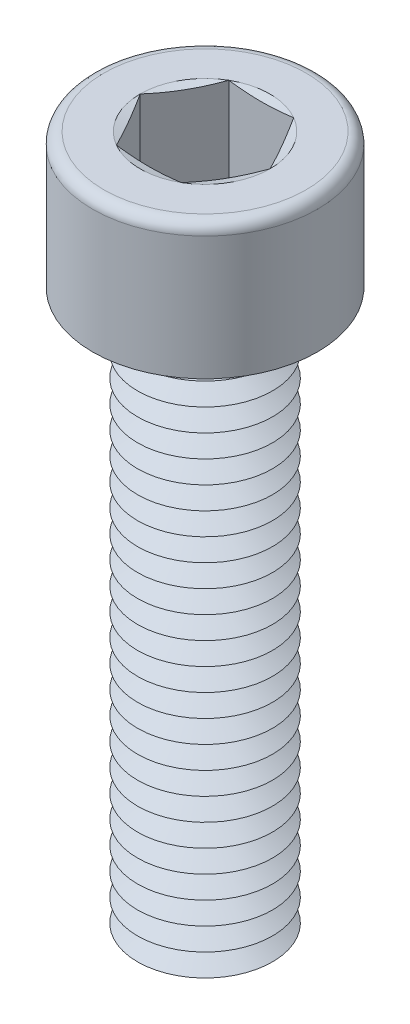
ISO-10303-21;
HEADER;
FILE_DESCRIPTION(('STEP AP214'),'2;1');
FILE_NAME('part.step','',(''),(''),'','','');
FILE_SCHEMA(('AUTOMOTIVE_DESIGN { 1 0 10303 214 1 1 1 1 }'));
ENDSEC;
DATA;
#1=APPLICATION_CONTEXT('core data for automotive mechanical design processes');
#2=APPLICATION_PROTOCOL_DEFINITION('international standard','automotive_design',2000,#1);
#3=PRODUCT_CONTEXT('',#1,'mechanical');
#4=PRODUCT('Part','Part','',(#3));
#5=PRODUCT_RELATED_PRODUCT_CATEGORY('part','',(#4));
#6=PRODUCT_DEFINITION_FORMATION('','',#4);
#7=PRODUCT_DEFINITION_CONTEXT('part definition',#1,'design');
#8=PRODUCT_DEFINITION('design','',#6,#7);
#9=PRODUCT_DEFINITION_SHAPE('','',#8);
#10=(LENGTH_UNIT() NAMED_UNIT(*) SI_UNIT(.MILLI.,.METRE.));
#11=(NAMED_UNIT(*) PLANE_ANGLE_UNIT() SI_UNIT($,.RADIAN.));
#12=(NAMED_UNIT(*) SI_UNIT($,.STERADIAN.) SOLID_ANGLE_UNIT());
#13=UNCERTAINTY_MEASURE_WITH_UNIT(LENGTH_MEASURE(1.E-05),#10,'distance_accuracy_value','');
#14=(GEOMETRIC_REPRESENTATION_CONTEXT(3) GLOBAL_UNCERTAINTY_ASSIGNED_CONTEXT((#13)) GLOBAL_UNIT_ASSIGNED_CONTEXT((#10,
#11,#12)) REPRESENTATION_CONTEXT('',''));
#15=CARTESIAN_POINT('',(0.,0.,0.));
#16=DIRECTION('',(0.,0.,1.));
#17=DIRECTION('',(1.,0.,0.));
#18=AXIS2_PLACEMENT_3D('',#15,#16,#17);
#19=CARTESIAN_POINT('',(0.,4.,0.));
#20=DIRECTION('',(0.,1.,0.));
#21=DIRECTION('',(0.,0.,1.));
#22=AXIS2_PLACEMENT_3D('',#19,#20,#21);
#23=CONICAL_SURFACE('',#22,2.13397459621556,1.0471975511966);
#24=CARTESIAN_POINT('',(0.,4.5,0.));
#25=DIRECTION('',(0.,1.,0.));
#26=DIRECTION('',(0.,0.,1.));
#27=AXIS2_PLACEMENT_3D('',#24,#25,#26);
#28=CIRCLE('',#27,3.);
#29=CARTESIAN_POINT('',(0.,4.5,3.));
#30=VERTEX_POINT('',#29);
#31=EDGE_CURVE('E509',#30,#30,#28,.T.);
#32=ORIENTED_EDGE('',*,*,#31,.F.);
#33=EDGE_LOOP('',(#32));
#34=FACE_BOUND('',#33,.T.);
#35=CARTESIAN_POINT('',(0.,4.,0.));
#36=DIRECTION('',(0.,1.,0.));
#37=DIRECTION('',(0.,0.,1.));
#38=AXIS2_PLACEMENT_3D('',#35,#36,#37);
#39=CIRCLE('',#38,2.13397459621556);
#40=CARTESIAN_POINT('',(0.,4.,2.13397459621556));
#41=VERTEX_POINT('',#40);
#42=EDGE_CURVE('E513',#41,#41,#39,.T.);
#43=ORIENTED_EDGE('',*,*,#42,.T.);
#44=EDGE_LOOP('',(#43));
#45=FACE_BOUND('',#44,.T.);
#46=ADVANCED_FACE('F41',(#34,#45),#23,.T.);
#47=CARTESIAN_POINT('',(0.,3.5,0.));
#48=DIRECTION('',(0.,-1.,0.));
#49=DIRECTION('',(0.,0.,-1.));
#50=AXIS2_PLACEMENT_3D('',#47,#48,#49);
#51=CONICAL_SURFACE('',#50,3.,1.0471975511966);
#52=ORIENTED_EDGE('',*,*,#42,.F.);
#53=EDGE_LOOP('',(#52));
#54=FACE_BOUND('',#53,.T.);
#55=CARTESIAN_POINT('',(0.,3.5,0.));
#56=DIRECTION('',(0.,1.,0.));
#57=DIRECTION('',(0.,0.,1.));
#58=AXIS2_PLACEMENT_3D('',#55,#56,#57);
#59=CIRCLE('',#58,3.);
#60=CARTESIAN_POINT('',(0.,3.5,3.));
#61=VERTEX_POINT('',#60);
#62=EDGE_CURVE('E517',#61,#61,#59,.T.);
#63=ORIENTED_EDGE('',*,*,#62,.T.);
#64=EDGE_LOOP('',(#63));
#65=FACE_BOUND('',#64,.T.);
#66=ADVANCED_FACE('F251',(#54,#65),#51,.T.);
#67=CARTESIAN_POINT('',(0.,0.,0.));
#68=DIRECTION('',(0.,1.,0.));
#69=DIRECTION('',(0.,0.,1.));
#70=AXIS2_PLACEMENT_3D('',#67,#68,#69);
#71=PLANE('',#70);
#72=CARTESIAN_POINT('',(0.,0.,0.));
#73=DIRECTION('',(0.,1.,0.));
#74=DIRECTION('',(0.,0.,1.));
#75=AXIS2_PLACEMENT_3D('',#72,#73,#74);
#76=CIRCLE('',#75,2.13397459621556);
#77=CARTESIAN_POINT('',(0.,0.,2.13397459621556));
#78=VERTEX_POINT('',#77);
#79=EDGE_CURVE('E545',#78,#78,#76,.T.);
#80=ORIENTED_EDGE('',*,*,#79,.F.);
#81=EDGE_LOOP('',(#80));
#82=FACE_BOUND('',#81,.T.);
#83=ADVANCED_FACE('F248',(#82),#71,.F.);
#84=CARTESIAN_POINT('',(0.,0.,0.));
#85=DIRECTION('',(0.,1.,0.));
#86=DIRECTION('',(0.,0.,1.));
#87=AXIS2_PLACEMENT_3D('',#84,#85,#86);
#88=CONICAL_SURFACE('',#87,2.13397459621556,1.0471975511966);
#89=CARTESIAN_POINT('',(0.,0.5,0.));
#90=DIRECTION('',(0.,1.,0.));
#91=DIRECTION('',(0.,0.,1.));
#92=AXIS2_PLACEMENT_3D('',#89,#90,#91);
#93=CIRCLE('',#92,3.);
#94=CARTESIAN_POINT('',(0.,0.5,3.));
#95=VERTEX_POINT('',#94);
#96=EDGE_CURVE('E541',#95,#95,#93,.T.);
#97=ORIENTED_EDGE('',*,*,#96,.F.);
#98=EDGE_LOOP('',(#97));
#99=FACE_BOUND('',#98,.T.);
#100=ORIENTED_EDGE('',*,*,#79,.T.);
#101=EDGE_LOOP('',(#100));
#102=FACE_BOUND('',#101,.T.);
#103=ADVANCED_FACE('F250',(#99,#102),#88,.T.);
#104=CARTESIAN_POINT('',(0.,0.5,0.));
#105=DIRECTION('',(0.,-1.,0.));
#106=DIRECTION('',(0.,0.,-1.));
#107=AXIS2_PLACEMENT_3D('',#104,#105,#106);
#108=CONICAL_SURFACE('',#107,3.,1.0471975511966);
#109=CARTESIAN_POINT('',(0.,1.,0.));
#110=DIRECTION('',(0.,1.,0.));
#111=DIRECTION('',(0.,0.,1.));
#112=AXIS2_PLACEMENT_3D('',#109,#110,#111);
#113=CIRCLE('',#112,2.13397459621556);
#114=CARTESIAN_POINT('',(0.,1.,2.13397459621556));
#115=VERTEX_POINT('',#114);
#116=EDGE_CURVE('E537',#115,#115,#113,.T.);
#117=ORIENTED_EDGE('',*,*,#116,.F.);
#118=EDGE_LOOP('',(#117));
#119=FACE_BOUND('',#118,.T.);
#120=ORIENTED_EDGE('',*,*,#96,.T.);
#121=EDGE_LOOP('',(#120));
#122=FACE_BOUND('',#121,.T.);
#123=ADVANCED_FACE('F291',(#119,#122),#108,.T.);
#124=CARTESIAN_POINT('',(0.,1.,0.));
#125=DIRECTION('',(0.,1.,0.));
#126=DIRECTION('',(0.,0.,1.));
#127=AXIS2_PLACEMENT_3D('',#124,#125,#126);
#128=CONICAL_SURFACE('',#127,2.13397459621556,1.0471975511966);
#129=CARTESIAN_POINT('',(0.,1.5,0.));
#130=DIRECTION('',(0.,1.,0.));
#131=DIRECTION('',(0.,0.,1.));
#132=AXIS2_PLACEMENT_3D('',#129,#130,#131);
#133=CIRCLE('',#132,3.);
#134=CARTESIAN_POINT('',(0.,1.5,3.));
#135=VERTEX_POINT('',#134);
#136=EDGE_CURVE('E533',#135,#135,#133,.T.);
#137=ORIENTED_EDGE('',*,*,#136,.F.);
#138=EDGE_LOOP('',(#137));
#139=FACE_BOUND('',#138,.T.);
#140=ORIENTED_EDGE('',*,*,#116,.T.);
#141=EDGE_LOOP('',(#140));
#142=FACE_BOUND('',#141,.T.);
#143=ADVANCED_FACE('F286',(#139,#142),#128,.T.);
#144=CARTESIAN_POINT('',(0.,1.5,0.));
#145=DIRECTION('',(0.,-1.,0.));
#146=DIRECTION('',(0.,0.,-1.));
#147=AXIS2_PLACEMENT_3D('',#144,#145,#146);
#148=CONICAL_SURFACE('',#147,3.,1.0471975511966);
#149=CARTESIAN_POINT('',(0.,2.,0.));
#150=DIRECTION('',(0.,1.,0.));
#151=DIRECTION('',(0.,0.,1.));
#152=AXIS2_PLACEMENT_3D('',#149,#150,#151);
#153=CIRCLE('',#152,2.13397459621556);
#154=CARTESIAN_POINT('',(0.,2.,2.13397459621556));
#155=VERTEX_POINT('',#154);
#156=EDGE_CURVE('E529',#155,#155,#153,.T.);
#157=ORIENTED_EDGE('',*,*,#156,.F.);
#158=EDGE_LOOP('',(#157));
#159=FACE_BOUND('',#158,.T.);
#160=ORIENTED_EDGE('',*,*,#136,.T.);
#161=EDGE_LOOP('',(#160));
#162=FACE_BOUND('',#161,.T.);
#163=ADVANCED_FACE('F283',(#159,#162),#148,.T.);
#164=CARTESIAN_POINT('',(0.,2.,0.));
#165=DIRECTION('',(0.,1.,0.));
#166=DIRECTION('',(0.,0.,1.));
#167=AXIS2_PLACEMENT_3D('',#164,#165,#166);
#168=CONICAL_SURFACE('',#167,2.13397459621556,1.0471975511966);
#169=CARTESIAN_POINT('',(0.,2.5,0.));
#170=DIRECTION('',(0.,1.,0.));
#171=DIRECTION('',(0.,0.,1.));
#172=AXIS2_PLACEMENT_3D('',#169,#170,#171);
#173=CIRCLE('',#172,3.);
#174=CARTESIAN_POINT('',(0.,2.5,3.));
#175=VERTEX_POINT('',#174);
#176=EDGE_CURVE('E525',#175,#175,#173,.T.);
#177=ORIENTED_EDGE('',*,*,#176,.F.);
#178=EDGE_LOOP('',(#177));
#179=FACE_BOUND('',#178,.T.);
#180=ORIENTED_EDGE('',*,*,#156,.T.);
#181=EDGE_LOOP('',(#180));
#182=FACE_BOUND('',#181,.T.);
#183=ADVANCED_FACE('F277',(#179,#182),#168,.T.);
#184=CARTESIAN_POINT('',(0.,2.5,0.));
#185=DIRECTION('',(0.,-1.,0.));
#186=DIRECTION('',(0.,0.,-1.));
#187=AXIS2_PLACEMENT_3D('',#184,#185,#186);
#188=CONICAL_SURFACE('',#187,3.,1.0471975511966);
#189=CARTESIAN_POINT('',(0.,3.,0.));
#190=DIRECTION('',(0.,1.,0.));
#191=DIRECTION('',(0.,0.,1.));
#192=AXIS2_PLACEMENT_3D('',#189,#190,#191);
#193=CIRCLE('',#192,2.13397459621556);
#194=CARTESIAN_POINT('',(0.,3.,2.13397459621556));
#195=VERTEX_POINT('',#194);
#196=EDGE_CURVE('E521',#195,#195,#193,.T.);
#197=ORIENTED_EDGE('',*,*,#196,.F.);
#198=EDGE_LOOP('',(#197));
#199=FACE_BOUND('',#198,.T.);
#200=ORIENTED_EDGE('',*,*,#176,.T.);
#201=EDGE_LOOP('',(#200));
#202=FACE_BOUND('',#201,.T.);
#203=ADVANCED_FACE('F273',(#199,#202),#188,.T.);
#204=CARTESIAN_POINT('',(0.,3.,0.));
#205=DIRECTION('',(0.,1.,0.));
#206=DIRECTION('',(0.,0.,1.));
#207=AXIS2_PLACEMENT_3D('',#204,#205,#206);
#208=CONICAL_SURFACE('',#207,2.13397459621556,1.0471975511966);
#209=ORIENTED_EDGE('',*,*,#62,.F.);
#210=EDGE_LOOP('',(#209));
#211=FACE_BOUND('',#210,.T.);
#212=ORIENTED_EDGE('',*,*,#196,.T.);
#213=EDGE_LOOP('',(#212));
#214=FACE_BOUND('',#213,.T.);
#215=ADVANCED_FACE('F276',(#211,#214),#208,.T.);
#216=CARTESIAN_POINT('',(0.,5.,0.));
#217=DIRECTION('',(0.,1.,0.));
#218=DIRECTION('',(0.,0.,1.));
#219=AXIS2_PLACEMENT_3D('',#216,#217,#218);
#220=CONICAL_SURFACE('',#219,2.13397459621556,1.0471975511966);
#221=CARTESIAN_POINT('',(0.,5.5,0.));
#222=DIRECTION('',(0.,1.,0.));
#223=DIRECTION('',(0.,0.,1.));
#224=AXIS2_PLACEMENT_3D('',#221,#222,#223);
#225=CIRCLE('',#224,3.);
#226=CARTESIAN_POINT('',(0.,5.5,3.));
#227=VERTEX_POINT('',#226);
#228=EDGE_CURVE('E501',#227,#227,#225,.T.);
#229=ORIENTED_EDGE('',*,*,#228,.F.);
#230=EDGE_LOOP('',(#229));
#231=FACE_BOUND('',#230,.T.);
#232=CARTESIAN_POINT('',(0.,5.,0.));
#233=DIRECTION('',(0.,1.,0.));
#234=DIRECTION('',(0.,0.,1.));
#235=AXIS2_PLACEMENT_3D('',#232,#233,#234);
#236=CIRCLE('',#235,2.13397459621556);
#237=CARTESIAN_POINT('',(0.,5.,2.13397459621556));
#238=VERTEX_POINT('',#237);
#239=EDGE_CURVE('E505',#238,#238,#236,.T.);
#240=ORIENTED_EDGE('',*,*,#239,.T.);
#241=EDGE_LOOP('',(#240));
#242=FACE_BOUND('',#241,.T.);
#243=ADVANCED_FACE('F281',(#231,#242),#220,.T.);
#244=CARTESIAN_POINT('',(0.,4.5,0.));
#245=DIRECTION('',(0.,-1.,0.));
#246=DIRECTION('',(0.,0.,-1.));
#247=AXIS2_PLACEMENT_3D('',#244,#245,#246);
#248=CONICAL_SURFACE('',#247,3.,1.0471975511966);
#249=ORIENTED_EDGE('',*,*,#239,.F.);
#250=EDGE_LOOP('',(#249));
#251=FACE_BOUND('',#250,.T.);
#252=ORIENTED_EDGE('',*,*,#31,.T.);
#253=EDGE_LOOP('',(#252));
#254=FACE_BOUND('',#253,.T.);
#255=ADVANCED_FACE('F784',(#251,#254),#248,.T.);
#256=CARTESIAN_POINT('',(0.,6.,0.));
#257=DIRECTION('',(0.,1.,0.));
#258=DIRECTION('',(0.,0.,1.));
#259=AXIS2_PLACEMENT_3D('',#256,#257,#258);
#260=CONICAL_SURFACE('',#259,2.13397459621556,1.0471975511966);
#261=CARTESIAN_POINT('',(0.,6.5,0.));
#262=DIRECTION('',(0.,1.,0.));
#263=DIRECTION('',(0.,0.,1.));
#264=AXIS2_PLACEMENT_3D('',#261,#262,#263);
#265=CIRCLE('',#264,3.);
#266=CARTESIAN_POINT('',(0.,6.5,3.));
#267=VERTEX_POINT('',#266);
#268=EDGE_CURVE('E493',#267,#267,#265,.T.);
#269=ORIENTED_EDGE('',*,*,#268,.F.);
#270=EDGE_LOOP('',(#269));
#271=FACE_BOUND('',#270,.T.);
#272=CARTESIAN_POINT('',(0.,6.,0.));
#273=DIRECTION('',(0.,1.,0.));
#274=DIRECTION('',(0.,0.,1.));
#275=AXIS2_PLACEMENT_3D('',#272,#273,#274);
#276=CIRCLE('',#275,2.13397459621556);
#277=CARTESIAN_POINT('',(0.,6.,2.13397459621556));
#278=VERTEX_POINT('',#277);
#279=EDGE_CURVE('E497',#278,#278,#276,.T.);
#280=ORIENTED_EDGE('',*,*,#279,.T.);
#281=EDGE_LOOP('',(#280));
#282=FACE_BOUND('',#281,.T.);
#283=ADVANCED_FACE('F793',(#271,#282),#260,.T.);
#284=CARTESIAN_POINT('',(0.,5.5,0.));
#285=DIRECTION('',(0.,-1.,0.));
#286=DIRECTION('',(0.,0.,-1.));
#287=AXIS2_PLACEMENT_3D('',#284,#285,#286);
#288=CONICAL_SURFACE('',#287,3.,1.0471975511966);
#289=ORIENTED_EDGE('',*,*,#279,.F.);
#290=EDGE_LOOP('',(#289));
#291=FACE_BOUND('',#290,.T.);
#292=ORIENTED_EDGE('',*,*,#228,.T.);
#293=EDGE_LOOP('',(#292));
#294=FACE_BOUND('',#293,.T.);
#295=ADVANCED_FACE('F803',(#291,#294),#288,.T.);
#296=CARTESIAN_POINT('',(0.,7.,0.));
#297=DIRECTION('',(0.,1.,0.));
#298=DIRECTION('',(0.,0.,1.));
#299=AXIS2_PLACEMENT_3D('',#296,#297,#298);
#300=CONICAL_SURFACE('',#299,2.13397459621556,1.0471975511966);
#301=CARTESIAN_POINT('',(0.,7.5,0.));
#302=DIRECTION('',(0.,1.,0.));
#303=DIRECTION('',(0.,0.,1.));
#304=AXIS2_PLACEMENT_3D('',#301,#302,#303);
#305=CIRCLE('',#304,3.);
#306=CARTESIAN_POINT('',(0.,7.5,3.));
#307=VERTEX_POINT('',#306);
#308=EDGE_CURVE('E485',#307,#307,#305,.T.);
#309=ORIENTED_EDGE('',*,*,#308,.F.);
#310=EDGE_LOOP('',(#309));
#311=FACE_BOUND('',#310,.T.);
#312=CARTESIAN_POINT('',(0.,7.,0.));
#313=DIRECTION('',(0.,1.,0.));
#314=DIRECTION('',(0.,0.,1.));
#315=AXIS2_PLACEMENT_3D('',#312,#313,#314);
#316=CIRCLE('',#315,2.13397459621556);
#317=CARTESIAN_POINT('',(0.,7.,2.13397459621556));
#318=VERTEX_POINT('',#317);
#319=EDGE_CURVE('E489',#318,#318,#316,.T.);
#320=ORIENTED_EDGE('',*,*,#319,.T.);
#321=EDGE_LOOP('',(#320));
#322=FACE_BOUND('',#321,.T.);
#323=ADVANCED_FACE('F813',(#311,#322),#300,.T.);
#324=CARTESIAN_POINT('',(0.,6.5,0.));
#325=DIRECTION('',(0.,-1.,0.));
#326=DIRECTION('',(0.,0.,-1.));
#327=AXIS2_PLACEMENT_3D('',#324,#325,#326);
#328=CONICAL_SURFACE('',#327,3.,1.0471975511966);
#329=ORIENTED_EDGE('',*,*,#319,.F.);
#330=EDGE_LOOP('',(#329));
#331=FACE_BOUND('',#330,.T.);
#332=ORIENTED_EDGE('',*,*,#268,.T.);
#333=EDGE_LOOP('',(#332));
#334=FACE_BOUND('',#333,.T.);
#335=ADVANCED_FACE('F823',(#331,#334),#328,.T.);
#336=CARTESIAN_POINT('',(0.,8.,0.));
#337=DIRECTION('',(0.,1.,0.));
#338=DIRECTION('',(0.,0.,1.));
#339=AXIS2_PLACEMENT_3D('',#336,#337,#338);
#340=CONICAL_SURFACE('',#339,2.13397459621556,1.0471975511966);
#341=CARTESIAN_POINT('',(0.,8.5,0.));
#342=DIRECTION('',(0.,1.,0.));
#343=DIRECTION('',(0.,0.,1.));
#344=AXIS2_PLACEMENT_3D('',#341,#342,#343);
#345=CIRCLE('',#344,3.);
#346=CARTESIAN_POINT('',(0.,8.5,3.));
#347=VERTEX_POINT('',#346);
#348=EDGE_CURVE('E477',#347,#347,#345,.T.);
#349=ORIENTED_EDGE('',*,*,#348,.F.);
#350=EDGE_LOOP('',(#349));
#351=FACE_BOUND('',#350,.T.);
#352=CARTESIAN_POINT('',(0.,8.,0.));
#353=DIRECTION('',(0.,1.,0.));
#354=DIRECTION('',(0.,0.,1.));
#355=AXIS2_PLACEMENT_3D('',#352,#353,#354);
#356=CIRCLE('',#355,2.13397459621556);
#357=CARTESIAN_POINT('',(0.,8.,2.13397459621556));
#358=VERTEX_POINT('',#357);
#359=EDGE_CURVE('E481',#358,#358,#356,.T.);
#360=ORIENTED_EDGE('',*,*,#359,.T.);
#361=EDGE_LOOP('',(#360));
#362=FACE_BOUND('',#361,.T.);
#363=ADVANCED_FACE('F833',(#351,#362),#340,.T.);
#364=CARTESIAN_POINT('',(0.,7.5,0.));
#365=DIRECTION('',(0.,-1.,0.));
#366=DIRECTION('',(0.,0.,-1.));
#367=AXIS2_PLACEMENT_3D('',#364,#365,#366);
#368=CONICAL_SURFACE('',#367,3.,1.0471975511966);
#369=ORIENTED_EDGE('',*,*,#359,.F.);
#370=EDGE_LOOP('',(#369));
#371=FACE_BOUND('',#370,.T.);
#372=ORIENTED_EDGE('',*,*,#308,.T.);
#373=EDGE_LOOP('',(#372));
#374=FACE_BOUND('',#373,.T.);
#375=ADVANCED_FACE('F843',(#371,#374),#368,.T.);
#376=CARTESIAN_POINT('',(0.,9.,0.));
#377=DIRECTION('',(0.,1.,0.));
#378=DIRECTION('',(0.,0.,1.));
#379=AXIS2_PLACEMENT_3D('',#376,#377,#378);
#380=CONICAL_SURFACE('',#379,2.13397459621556,1.0471975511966);
#381=CARTESIAN_POINT('',(0.,9.5,0.));
#382=DIRECTION('',(0.,1.,0.));
#383=DIRECTION('',(0.,0.,1.));
#384=AXIS2_PLACEMENT_3D('',#381,#382,#383);
#385=CIRCLE('',#384,3.);
#386=CARTESIAN_POINT('',(0.,9.5,3.));
#387=VERTEX_POINT('',#386);
#388=EDGE_CURVE('E469',#387,#387,#385,.T.);
#389=ORIENTED_EDGE('',*,*,#388,.F.);
#390=EDGE_LOOP('',(#389));
#391=FACE_BOUND('',#390,.T.);
#392=CARTESIAN_POINT('',(0.,9.,0.));
#393=DIRECTION('',(0.,1.,0.));
#394=DIRECTION('',(0.,0.,1.));
#395=AXIS2_PLACEMENT_3D('',#392,#393,#394);
#396=CIRCLE('',#395,2.13397459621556);
#397=CARTESIAN_POINT('',(0.,9.,2.13397459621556));
#398=VERTEX_POINT('',#397);
#399=EDGE_CURVE('E473',#398,#398,#396,.T.);
#400=ORIENTED_EDGE('',*,*,#399,.T.);
#401=EDGE_LOOP('',(#400));
#402=FACE_BOUND('',#401,.T.);
#403=ADVANCED_FACE('F853',(#391,#402),#380,.T.);
#404=CARTESIAN_POINT('',(0.,8.5,0.));
#405=DIRECTION('',(0.,-1.,0.));
#406=DIRECTION('',(0.,0.,-1.));
#407=AXIS2_PLACEMENT_3D('',#404,#405,#406);
#408=CONICAL_SURFACE('',#407,3.,1.0471975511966);
#409=ORIENTED_EDGE('',*,*,#399,.F.);
#410=EDGE_LOOP('',(#409));
#411=FACE_BOUND('',#410,.T.);
#412=ORIENTED_EDGE('',*,*,#348,.T.);
#413=EDGE_LOOP('',(#412));
#414=FACE_BOUND('',#413,.T.);
#415=ADVANCED_FACE('F863',(#411,#414),#408,.T.);
#416=CARTESIAN_POINT('',(0.,10.,0.));
#417=DIRECTION('',(0.,1.,0.));
#418=DIRECTION('',(0.,0.,1.));
#419=AXIS2_PLACEMENT_3D('',#416,#417,#418);
#420=CONICAL_SURFACE('',#419,2.13397459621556,1.0471975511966);
#421=CARTESIAN_POINT('',(0.,10.5,0.));
#422=DIRECTION('',(0.,1.,0.));
#423=DIRECTION('',(0.,0.,1.));
#424=AXIS2_PLACEMENT_3D('',#421,#422,#423);
#425=CIRCLE('',#424,3.);
#426=CARTESIAN_POINT('',(0.,10.5,3.));
#427=VERTEX_POINT('',#426);
#428=EDGE_CURVE('E461',#427,#427,#425,.T.);
#429=ORIENTED_EDGE('',*,*,#428,.F.);
#430=EDGE_LOOP('',(#429));
#431=FACE_BOUND('',#430,.T.);
#432=CARTESIAN_POINT('',(0.,10.,0.));
#433=DIRECTION('',(0.,1.,0.));
#434=DIRECTION('',(0.,0.,1.));
#435=AXIS2_PLACEMENT_3D('',#432,#433,#434);
#436=CIRCLE('',#435,2.13397459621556);
#437=CARTESIAN_POINT('',(0.,10.,2.13397459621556));
#438=VERTEX_POINT('',#437);
#439=EDGE_CURVE('E465',#438,#438,#436,.T.);
#440=ORIENTED_EDGE('',*,*,#439,.T.);
#441=EDGE_LOOP('',(#440));
#442=FACE_BOUND('',#441,.T.);
#443=ADVANCED_FACE('F873',(#431,#442),#420,.T.);
#444=CARTESIAN_POINT('',(0.,9.5,0.));
#445=DIRECTION('',(0.,-1.,0.));
#446=DIRECTION('',(0.,0.,-1.));
#447=AXIS2_PLACEMENT_3D('',#444,#445,#446);
#448=CONICAL_SURFACE('',#447,3.,1.0471975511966);
#449=ORIENTED_EDGE('',*,*,#439,.F.);
#450=EDGE_LOOP('',(#449));
#451=FACE_BOUND('',#450,.T.);
#452=ORIENTED_EDGE('',*,*,#388,.T.);
#453=EDGE_LOOP('',(#452));
#454=FACE_BOUND('',#453,.T.);
#455=ADVANCED_FACE('F883',(#451,#454),#448,.T.);
#456=CARTESIAN_POINT('',(0.,11.,0.));
#457=DIRECTION('',(0.,1.,0.));
#458=DIRECTION('',(0.,0.,1.));
#459=AXIS2_PLACEMENT_3D('',#456,#457,#458);
#460=CONICAL_SURFACE('',#459,2.13397459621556,1.0471975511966);
#461=CARTESIAN_POINT('',(0.,11.5,0.));
#462=DIRECTION('',(0.,1.,0.));
#463=DIRECTION('',(0.,0.,1.));
#464=AXIS2_PLACEMENT_3D('',#461,#462,#463);
#465=CIRCLE('',#464,3.);
#466=CARTESIAN_POINT('',(0.,11.5,3.));
#467=VERTEX_POINT('',#466);
#468=EDGE_CURVE('E453',#467,#467,#465,.T.);
#469=ORIENTED_EDGE('',*,*,#468,.F.);
#470=EDGE_LOOP('',(#469));
#471=FACE_BOUND('',#470,.T.);
#472=CARTESIAN_POINT('',(0.,11.,0.));
#473=DIRECTION('',(0.,1.,0.));
#474=DIRECTION('',(0.,0.,1.));
#475=AXIS2_PLACEMENT_3D('',#472,#473,#474);
#476=CIRCLE('',#475,2.13397459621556);
#477=CARTESIAN_POINT('',(0.,11.,2.13397459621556));
#478=VERTEX_POINT('',#477);
#479=EDGE_CURVE('E457',#478,#478,#476,.T.);
#480=ORIENTED_EDGE('',*,*,#479,.T.);
#481=EDGE_LOOP('',(#480));
#482=FACE_BOUND('',#481,.T.);
#483=ADVANCED_FACE('F893',(#471,#482),#460,.T.);
#484=CARTESIAN_POINT('',(0.,10.5,0.));
#485=DIRECTION('',(0.,-1.,0.));
#486=DIRECTION('',(0.,0.,-1.));
#487=AXIS2_PLACEMENT_3D('',#484,#485,#486);
#488=CONICAL_SURFACE('',#487,3.,1.0471975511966);
#489=ORIENTED_EDGE('',*,*,#479,.F.);
#490=EDGE_LOOP('',(#489));
#491=FACE_BOUND('',#490,.T.);
#492=ORIENTED_EDGE('',*,*,#428,.T.);
#493=EDGE_LOOP('',(#492));
#494=FACE_BOUND('',#493,.T.);
#495=ADVANCED_FACE('F903',(#491,#494),#488,.T.);
#496=CARTESIAN_POINT('',(0.,12.,0.));
#497=DIRECTION('',(0.,1.,0.));
#498=DIRECTION('',(0.,0.,1.));
#499=AXIS2_PLACEMENT_3D('',#496,#497,#498);
#500=CONICAL_SURFACE('',#499,2.13397459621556,1.0471975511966);
#501=CARTESIAN_POINT('',(0.,12.5,0.));
#502=DIRECTION('',(0.,1.,0.));
#503=DIRECTION('',(0.,0.,1.));
#504=AXIS2_PLACEMENT_3D('',#501,#502,#503);
#505=CIRCLE('',#504,3.);
#506=CARTESIAN_POINT('',(0.,12.5,3.));
#507=VERTEX_POINT('',#506);
#508=EDGE_CURVE('E445',#507,#507,#505,.T.);
#509=ORIENTED_EDGE('',*,*,#508,.F.);
#510=EDGE_LOOP('',(#509));
#511=FACE_BOUND('',#510,.T.);
#512=CARTESIAN_POINT('',(0.,12.,0.));
#513=DIRECTION('',(0.,1.,0.));
#514=DIRECTION('',(0.,0.,1.));
#515=AXIS2_PLACEMENT_3D('',#512,#513,#514);
#516=CIRCLE('',#515,2.13397459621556);
#517=CARTESIAN_POINT('',(0.,12.,2.13397459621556));
#518=VERTEX_POINT('',#517);
#519=EDGE_CURVE('E449',#518,#518,#516,.T.);
#520=ORIENTED_EDGE('',*,*,#519,.T.);
#521=EDGE_LOOP('',(#520));
#522=FACE_BOUND('',#521,.T.);
#523=ADVANCED_FACE('F913',(#511,#522),#500,.T.);
#524=CARTESIAN_POINT('',(0.,11.5,0.));
#525=DIRECTION('',(0.,-1.,0.));
#526=DIRECTION('',(0.,0.,-1.));
#527=AXIS2_PLACEMENT_3D('',#524,#525,#526);
#528=CONICAL_SURFACE('',#527,3.,1.0471975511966);
#529=ORIENTED_EDGE('',*,*,#519,.F.);
#530=EDGE_LOOP('',(#529));
#531=FACE_BOUND('',#530,.T.);
#532=ORIENTED_EDGE('',*,*,#468,.T.);
#533=EDGE_LOOP('',(#532));
#534=FACE_BOUND('',#533,.T.);
#535=ADVANCED_FACE('F923',(#531,#534),#528,.T.);
#536=CARTESIAN_POINT('',(0.,13.,0.));
#537=DIRECTION('',(0.,1.,0.));
#538=DIRECTION('',(0.,0.,1.));
#539=AXIS2_PLACEMENT_3D('',#536,#537,#538);
#540=CONICAL_SURFACE('',#539,2.13397459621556,1.0471975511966);
#541=CARTESIAN_POINT('',(0.,13.5,0.));
#542=DIRECTION('',(0.,1.,0.));
#543=DIRECTION('',(0.,0.,1.));
#544=AXIS2_PLACEMENT_3D('',#541,#542,#543);
#545=CIRCLE('',#544,3.);
#546=CARTESIAN_POINT('',(0.,13.5,3.));
#547=VERTEX_POINT('',#546);
#548=EDGE_CURVE('E438',#547,#547,#545,.T.);
#549=ORIENTED_EDGE('',*,*,#548,.F.);
#550=EDGE_LOOP('',(#549));
#551=FACE_BOUND('',#550,.T.);
#552=CARTESIAN_POINT('',(0.,13.,0.));
#553=DIRECTION('',(0.,1.,0.));
#554=DIRECTION('',(0.,0.,1.));
#555=AXIS2_PLACEMENT_3D('',#552,#553,#554);
#556=CIRCLE('',#555,2.13397459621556);
#557=CARTESIAN_POINT('',(0.,13.,2.13397459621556));
#558=VERTEX_POINT('',#557);
#559=EDGE_CURVE('E441',#558,#558,#556,.T.);
#560=ORIENTED_EDGE('',*,*,#559,.T.);
#561=EDGE_LOOP('',(#560));
#562=FACE_BOUND('',#561,.T.);
#563=ADVANCED_FACE('F933',(#551,#562),#540,.T.);
#564=CARTESIAN_POINT('',(0.,12.5,0.));
#565=DIRECTION('',(0.,-1.,0.));
#566=DIRECTION('',(0.,0.,-1.));
#567=AXIS2_PLACEMENT_3D('',#564,#565,#566);
#568=CONICAL_SURFACE('',#567,3.,1.0471975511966);
#569=ORIENTED_EDGE('',*,*,#559,.F.);
#570=EDGE_LOOP('',(#569));
#571=FACE_BOUND('',#570,.T.);
#572=ORIENTED_EDGE('',*,*,#508,.T.);
#573=EDGE_LOOP('',(#572));
#574=FACE_BOUND('',#573,.T.);
#575=ADVANCED_FACE('F943',(#571,#574),#568,.T.);
#576=CARTESIAN_POINT('',(0.,14.,0.));
#577=DIRECTION('',(0.,1.,0.));
#578=DIRECTION('',(0.,0.,1.));
#579=AXIS2_PLACEMENT_3D('',#576,#577,#578);
#580=CONICAL_SURFACE('',#579,2.13397459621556,1.0471975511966);
#581=CARTESIAN_POINT('',(0.,14.5,0.));
#582=DIRECTION('',(0.,1.,0.));
#583=DIRECTION('',(0.,0.,1.));
#584=AXIS2_PLACEMENT_3D('',#581,#582,#583);
#585=CIRCLE('',#584,3.);
#586=CARTESIAN_POINT('',(0.,14.5,3.));
#587=VERTEX_POINT('',#586);
#588=EDGE_CURVE('E430',#587,#587,#585,.T.);
#589=ORIENTED_EDGE('',*,*,#588,.F.);
#590=EDGE_LOOP('',(#589));
#591=FACE_BOUND('',#590,.T.);
#592=CARTESIAN_POINT('',(0.,14.,0.));
#593=DIRECTION('',(0.,1.,0.));
#594=DIRECTION('',(0.,0.,1.));
#595=AXIS2_PLACEMENT_3D('',#592,#593,#594);
#596=CIRCLE('',#595,2.13397459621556);
#597=CARTESIAN_POINT('',(0.,14.,2.13397459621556));
#598=VERTEX_POINT('',#597);
#599=EDGE_CURVE('E434',#598,#598,#596,.T.);
#600=ORIENTED_EDGE('',*,*,#599,.T.);
#601=EDGE_LOOP('',(#600));
#602=FACE_BOUND('',#601,.T.);
#603=ADVANCED_FACE('F953',(#591,#602),#580,.T.);
#604=CARTESIAN_POINT('',(0.,13.5,0.));
#605=DIRECTION('',(0.,-1.,0.));
#606=DIRECTION('',(0.,0.,-1.));
#607=AXIS2_PLACEMENT_3D('',#604,#605,#606);
#608=CONICAL_SURFACE('',#607,3.,1.0471975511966);
#609=ORIENTED_EDGE('',*,*,#599,.F.);
#610=EDGE_LOOP('',(#609));
#611=FACE_BOUND('',#610,.T.);
#612=ORIENTED_EDGE('',*,*,#548,.T.);
#613=EDGE_LOOP('',(#612));
#614=FACE_BOUND('',#613,.T.);
#615=ADVANCED_FACE('F963',(#611,#614),#608,.T.);
#616=CARTESIAN_POINT('',(0.,15.,0.));
#617=DIRECTION('',(0.,1.,0.));
#618=DIRECTION('',(0.,0.,1.));
#619=AXIS2_PLACEMENT_3D('',#616,#617,#618);
#620=CONICAL_SURFACE('',#619,2.13397459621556,1.0471975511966);
#621=CARTESIAN_POINT('',(0.,15.5,0.));
#622=DIRECTION('',(0.,1.,0.));
#623=DIRECTION('',(0.,0.,1.));
#624=AXIS2_PLACEMENT_3D('',#621,#622,#623);
#625=CIRCLE('',#624,3.);
#626=CARTESIAN_POINT('',(0.,15.5,3.));
#627=VERTEX_POINT('',#626);
#628=EDGE_CURVE('E422',#627,#627,#625,.T.);
#629=ORIENTED_EDGE('',*,*,#628,.F.);
#630=EDGE_LOOP('',(#629));
#631=FACE_BOUND('',#630,.T.);
#632=CARTESIAN_POINT('',(0.,15.,0.));
#633=DIRECTION('',(0.,1.,0.));
#634=DIRECTION('',(0.,0.,1.));
#635=AXIS2_PLACEMENT_3D('',#632,#633,#634);
#636=CIRCLE('',#635,2.13397459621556);
#637=CARTESIAN_POINT('',(0.,15.,2.13397459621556));
#638=VERTEX_POINT('',#637);
#639=EDGE_CURVE('E426',#638,#638,#636,.T.);
#640=ORIENTED_EDGE('',*,*,#639,.T.);
#641=EDGE_LOOP('',(#640));
#642=FACE_BOUND('',#641,.T.);
#643=ADVANCED_FACE('F973',(#631,#642),#620,.T.);
#644=CARTESIAN_POINT('',(0.,14.5,0.));
#645=DIRECTION('',(0.,-1.,0.));
#646=DIRECTION('',(0.,0.,-1.));
#647=AXIS2_PLACEMENT_3D('',#644,#645,#646);
#648=CONICAL_SURFACE('',#647,3.,1.0471975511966);
#649=ORIENTED_EDGE('',*,*,#639,.F.);
#650=EDGE_LOOP('',(#649));
#651=FACE_BOUND('',#650,.T.);
#652=ORIENTED_EDGE('',*,*,#588,.T.);
#653=EDGE_LOOP('',(#652));
#654=FACE_BOUND('',#653,.T.);
#655=ADVANCED_FACE('F983',(#651,#654),#648,.T.);
#656=CARTESIAN_POINT('',(0.,16.,0.));
#657=DIRECTION('',(0.,1.,0.));
#658=DIRECTION('',(0.,0.,1.));
#659=AXIS2_PLACEMENT_3D('',#656,#657,#658);
#660=CONICAL_SURFACE('',#659,2.13397459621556,1.0471975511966);
#661=CARTESIAN_POINT('',(0.,16.5,0.));
#662=DIRECTION('',(0.,1.,0.));
#663=DIRECTION('',(0.,0.,1.));
#664=AXIS2_PLACEMENT_3D('',#661,#662,#663);
#665=CIRCLE('',#664,3.);
#666=CARTESIAN_POINT('',(0.,16.5,3.));
#667=VERTEX_POINT('',#666);
#668=EDGE_CURVE('E414',#667,#667,#665,.T.);
#669=ORIENTED_EDGE('',*,*,#668,.F.);
#670=EDGE_LOOP('',(#669));
#671=FACE_BOUND('',#670,.T.);
#672=CARTESIAN_POINT('',(0.,16.,0.));
#673=DIRECTION('',(0.,1.,0.));
#674=DIRECTION('',(0.,0.,1.));
#675=AXIS2_PLACEMENT_3D('',#672,#673,#674);
#676=CIRCLE('',#675,2.13397459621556);
#677=CARTESIAN_POINT('',(0.,16.,2.13397459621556));
#678=VERTEX_POINT('',#677);
#679=EDGE_CURVE('E418',#678,#678,#676,.T.);
#680=ORIENTED_EDGE('',*,*,#679,.T.);
#681=EDGE_LOOP('',(#680));
#682=FACE_BOUND('',#681,.T.);
#683=ADVANCED_FACE('F993',(#671,#682),#660,.T.);
#684=CARTESIAN_POINT('',(0.,15.5,0.));
#685=DIRECTION('',(0.,-1.,0.));
#686=DIRECTION('',(0.,0.,-1.));
#687=AXIS2_PLACEMENT_3D('',#684,#685,#686);
#688=CONICAL_SURFACE('',#687,3.,1.0471975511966);
#689=ORIENTED_EDGE('',*,*,#679,.F.);
#690=EDGE_LOOP('',(#689));
#691=FACE_BOUND('',#690,.T.);
#692=ORIENTED_EDGE('',*,*,#628,.T.);
#693=EDGE_LOOP('',(#692));
#694=FACE_BOUND('',#693,.T.);
#695=ADVANCED_FACE('F1003',(#691,#694),#688,.T.);
#696=CARTESIAN_POINT('',(0.,17.,0.));
#697=DIRECTION('',(0.,1.,0.));
#698=DIRECTION('',(0.,0.,1.));
#699=AXIS2_PLACEMENT_3D('',#696,#697,#698);
#700=CONICAL_SURFACE('',#699,2.13397459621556,1.0471975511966);
#701=CARTESIAN_POINT('',(0.,17.5,0.));
#702=DIRECTION('',(0.,1.,0.));
#703=DIRECTION('',(0.,0.,1.));
#704=AXIS2_PLACEMENT_3D('',#701,#702,#703);
#705=CIRCLE('',#704,3.);
#706=CARTESIAN_POINT('',(0.,17.5,3.));
#707=VERTEX_POINT('',#706);
#708=EDGE_CURVE('E407',#707,#707,#705,.T.);
#709=ORIENTED_EDGE('',*,*,#708,.F.);
#710=EDGE_LOOP('',(#709));
#711=FACE_BOUND('',#710,.T.);
#712=CARTESIAN_POINT('',(0.,17.,0.));
#713=DIRECTION('',(0.,1.,0.));
#714=DIRECTION('',(0.,0.,1.));
#715=AXIS2_PLACEMENT_3D('',#712,#713,#714);
#716=CIRCLE('',#715,2.13397459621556);
#717=CARTESIAN_POINT('',(0.,17.,2.13397459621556));
#718=VERTEX_POINT('',#717);
#719=EDGE_CURVE('E411',#718,#718,#716,.T.);
#720=ORIENTED_EDGE('',*,*,#719,.T.);
#721=EDGE_LOOP('',(#720));
#722=FACE_BOUND('',#721,.T.);
#723=ADVANCED_FACE('F1013',(#711,#722),#700,.T.);
#724=CARTESIAN_POINT('',(0.,16.5,0.));
#725=DIRECTION('',(0.,-1.,0.));
#726=DIRECTION('',(0.,0.,-1.));
#727=AXIS2_PLACEMENT_3D('',#724,#725,#726);
#728=CONICAL_SURFACE('',#727,3.,1.0471975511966);
#729=ORIENTED_EDGE('',*,*,#719,.F.);
#730=EDGE_LOOP('',(#729));
#731=FACE_BOUND('',#730,.T.);
#732=ORIENTED_EDGE('',*,*,#668,.T.);
#733=EDGE_LOOP('',(#732));
#734=FACE_BOUND('',#733,.T.);
#735=ADVANCED_FACE('F1023',(#731,#734),#728,.T.);
#736=CARTESIAN_POINT('',(0.,18.,0.));
#737=DIRECTION('',(0.,1.,0.));
#738=DIRECTION('',(0.,0.,1.));
#739=AXIS2_PLACEMENT_3D('',#736,#737,#738);
#740=CONICAL_SURFACE('',#739,2.13397459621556,1.0471975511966);
#741=CARTESIAN_POINT('',(0.,18.5,0.));
#742=DIRECTION('',(0.,1.,0.));
#743=DIRECTION('',(0.,0.,1.));
#744=AXIS2_PLACEMENT_3D('',#741,#742,#743);
#745=CIRCLE('',#744,3.);
#746=CARTESIAN_POINT('',(0.,18.5,3.));
#747=VERTEX_POINT('',#746);
#748=EDGE_CURVE('E399',#747,#747,#745,.T.);
#749=ORIENTED_EDGE('',*,*,#748,.F.);
#750=EDGE_LOOP('',(#749));
#751=FACE_BOUND('',#750,.T.);
#752=CARTESIAN_POINT('',(0.,18.,0.));
#753=DIRECTION('',(0.,1.,0.));
#754=DIRECTION('',(0.,0.,1.));
#755=AXIS2_PLACEMENT_3D('',#752,#753,#754);
#756=CIRCLE('',#755,2.13397459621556);
#757=CARTESIAN_POINT('',(0.,18.,2.13397459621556));
#758=VERTEX_POINT('',#757);
#759=EDGE_CURVE('E403',#758,#758,#756,.T.);
#760=ORIENTED_EDGE('',*,*,#759,.T.);
#761=EDGE_LOOP('',(#760));
#762=FACE_BOUND('',#761,.T.);
#763=ADVANCED_FACE('F1033',(#751,#762),#740,.T.);
#764=CARTESIAN_POINT('',(0.,17.5,0.));
#765=DIRECTION('',(0.,-1.,0.));
#766=DIRECTION('',(0.,0.,-1.));
#767=AXIS2_PLACEMENT_3D('',#764,#765,#766);
#768=CONICAL_SURFACE('',#767,3.,1.0471975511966);
#769=ORIENTED_EDGE('',*,*,#759,.F.);
#770=EDGE_LOOP('',(#769));
#771=FACE_BOUND('',#770,.T.);
#772=ORIENTED_EDGE('',*,*,#708,.T.);
#773=EDGE_LOOP('',(#772));
#774=FACE_BOUND('',#773,.T.);
#775=ADVANCED_FACE('F1043',(#771,#774),#768,.T.);
#776=CARTESIAN_POINT('',(0.,19.,0.));
#777=DIRECTION('',(0.,1.,0.));
#778=DIRECTION('',(0.,0.,1.));
#779=AXIS2_PLACEMENT_3D('',#776,#777,#778);
#780=CONICAL_SURFACE('',#779,2.13397459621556,1.0471975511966);
#781=CARTESIAN_POINT('',(0.,19.5,0.));
#782=DIRECTION('',(0.,1.,0.));
#783=DIRECTION('',(0.,0.,1.));
#784=AXIS2_PLACEMENT_3D('',#781,#782,#783);
#785=CIRCLE('',#784,3.);
#786=CARTESIAN_POINT('',(0.,19.5,3.));
#787=VERTEX_POINT('',#786);
#788=EDGE_CURVE('E392',#787,#787,#785,.T.);
#789=ORIENTED_EDGE('',*,*,#788,.F.);
#790=EDGE_LOOP('',(#789));
#791=FACE_BOUND('',#790,.T.);
#792=CARTESIAN_POINT('',(0.,19.,0.));
#793=DIRECTION('',(0.,1.,0.));
#794=DIRECTION('',(0.,0.,1.));
#795=AXIS2_PLACEMENT_3D('',#792,#793,#794);
#796=CIRCLE('',#795,2.13397459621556);
#797=CARTESIAN_POINT('',(0.,19.,2.13397459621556));
#798=VERTEX_POINT('',#797);
#799=EDGE_CURVE('E396',#798,#798,#796,.T.);
#800=ORIENTED_EDGE('',*,*,#799,.T.);
#801=EDGE_LOOP('',(#800));
#802=FACE_BOUND('',#801,.T.);
#803=ADVANCED_FACE('F1053',(#791,#802),#780,.T.);
#804=CARTESIAN_POINT('',(0.,18.5,0.));
#805=DIRECTION('',(0.,-1.,0.));
#806=DIRECTION('',(0.,0.,-1.));
#807=AXIS2_PLACEMENT_3D('',#804,#805,#806);
#808=CONICAL_SURFACE('',#807,3.,1.0471975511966);
#809=ORIENTED_EDGE('',*,*,#799,.F.);
#810=EDGE_LOOP('',(#809));
#811=FACE_BOUND('',#810,.T.);
#812=ORIENTED_EDGE('',*,*,#748,.T.);
#813=EDGE_LOOP('',(#812));
#814=FACE_BOUND('',#813,.T.);
#815=ADVANCED_FACE('F1063',(#811,#814),#808,.T.);
#816=CARTESIAN_POINT('',(0.,20.,0.));
#817=DIRECTION('',(0.,1.,0.));
#818=DIRECTION('',(0.,0.,1.));
#819=AXIS2_PLACEMENT_3D('',#816,#817,#818);
#820=CONICAL_SURFACE('',#819,2.13397459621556,1.0471975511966);
#821=CARTESIAN_POINT('',(0.,20.5,0.));
#822=DIRECTION('',(0.,1.,0.));
#823=DIRECTION('',(0.,0.,1.));
#824=AXIS2_PLACEMENT_3D('',#821,#822,#823);
#825=CIRCLE('',#824,3.);
#826=CARTESIAN_POINT('',(0.,20.5,3.));
#827=VERTEX_POINT('',#826);
#828=EDGE_CURVE('E384',#827,#827,#825,.T.);
#829=ORIENTED_EDGE('',*,*,#828,.F.);
#830=EDGE_LOOP('',(#829));
#831=FACE_BOUND('',#830,.T.);
#832=CARTESIAN_POINT('',(0.,20.,0.));
#833=DIRECTION('',(0.,1.,0.));
#834=DIRECTION('',(0.,0.,1.));
#835=AXIS2_PLACEMENT_3D('',#832,#833,#834);
#836=CIRCLE('',#835,2.13397459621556);
#837=CARTESIAN_POINT('',(0.,20.,2.13397459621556));
#838=VERTEX_POINT('',#837);
#839=EDGE_CURVE('E388',#838,#838,#836,.T.);
#840=ORIENTED_EDGE('',*,*,#839,.T.);
#841=EDGE_LOOP('',(#840));
#842=FACE_BOUND('',#841,.T.);
#843=ADVANCED_FACE('F1073',(#831,#842),#820,.T.);
#844=CARTESIAN_POINT('',(0.,19.5,0.));
#845=DIRECTION('',(0.,-1.,0.));
#846=DIRECTION('',(0.,0.,-1.));
#847=AXIS2_PLACEMENT_3D('',#844,#845,#846);
#848=CONICAL_SURFACE('',#847,3.,1.0471975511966);
#849=ORIENTED_EDGE('',*,*,#839,.F.);
#850=EDGE_LOOP('',(#849));
#851=FACE_BOUND('',#850,.T.);
#852=ORIENTED_EDGE('',*,*,#788,.T.);
#853=EDGE_LOOP('',(#852));
#854=FACE_BOUND('',#853,.T.);
#855=ADVANCED_FACE('F1083',(#851,#854),#848,.T.);
#856=CARTESIAN_POINT('',(0.,21.,0.));
#857=DIRECTION('',(0.,1.,0.));
#858=DIRECTION('',(0.,0.,1.));
#859=AXIS2_PLACEMENT_3D('',#856,#857,#858);
#860=CONICAL_SURFACE('',#859,2.13397459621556,1.0471975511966);
#861=CARTESIAN_POINT('',(0.,21.5,0.));
#862=DIRECTION('',(0.,1.,0.));
#863=DIRECTION('',(0.,0.,1.));
#864=AXIS2_PLACEMENT_3D('',#861,#862,#863);
#865=CIRCLE('',#864,3.);
#866=CARTESIAN_POINT('',(0.,21.5,3.));
#867=VERTEX_POINT('',#866);
#868=EDGE_CURVE('E376',#867,#867,#865,.T.);
#869=ORIENTED_EDGE('',*,*,#868,.F.);
#870=EDGE_LOOP('',(#869));
#871=FACE_BOUND('',#870,.T.);
#872=CARTESIAN_POINT('',(0.,21.,0.));
#873=DIRECTION('',(0.,1.,0.));
#874=DIRECTION('',(0.,0.,1.));
#875=AXIS2_PLACEMENT_3D('',#872,#873,#874);
#876=CIRCLE('',#875,2.13397459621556);
#877=CARTESIAN_POINT('',(0.,21.,2.13397459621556));
#878=VERTEX_POINT('',#877);
#879=EDGE_CURVE('E380',#878,#878,#876,.T.);
#880=ORIENTED_EDGE('',*,*,#879,.T.);
#881=EDGE_LOOP('',(#880));
#882=FACE_BOUND('',#881,.T.);
#883=ADVANCED_FACE('F1093',(#871,#882),#860,.T.);
#884=CARTESIAN_POINT('',(0.,20.5,0.));
#885=DIRECTION('',(0.,-1.,0.));
#886=DIRECTION('',(0.,0.,-1.));
#887=AXIS2_PLACEMENT_3D('',#884,#885,#886);
#888=CONICAL_SURFACE('',#887,3.,1.0471975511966);
#889=ORIENTED_EDGE('',*,*,#879,.F.);
#890=EDGE_LOOP('',(#889));
#891=FACE_BOUND('',#890,.T.);
#892=ORIENTED_EDGE('',*,*,#828,.T.);
#893=EDGE_LOOP('',(#892));
#894=FACE_BOUND('',#893,.T.);
#895=ADVANCED_FACE('F1103',(#891,#894),#888,.T.);
#896=CARTESIAN_POINT('',(0.,22.,0.));
#897=DIRECTION('',(0.,1.,0.));
#898=DIRECTION('',(0.,0.,1.));
#899=AXIS2_PLACEMENT_3D('',#896,#897,#898);
#900=CONICAL_SURFACE('',#899,2.13397459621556,1.0471975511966);
#901=CARTESIAN_POINT('',(0.,22.5,0.));
#902=DIRECTION('',(0.,1.,0.));
#903=DIRECTION('',(0.,0.,1.));
#904=AXIS2_PLACEMENT_3D('',#901,#902,#903);
#905=CIRCLE('',#904,3.);
#906=CARTESIAN_POINT('',(0.,22.5,3.));
#907=VERTEX_POINT('',#906);
#908=EDGE_CURVE('E368',#907,#907,#905,.T.);
#909=ORIENTED_EDGE('',*,*,#908,.F.);
#910=EDGE_LOOP('',(#909));
#911=FACE_BOUND('',#910,.T.);
#912=CARTESIAN_POINT('',(0.,22.,0.));
#913=DIRECTION('',(0.,1.,0.));
#914=DIRECTION('',(0.,0.,1.));
#915=AXIS2_PLACEMENT_3D('',#912,#913,#914);
#916=CIRCLE('',#915,2.13397459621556);
#917=CARTESIAN_POINT('',(0.,22.,2.13397459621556));
#918=VERTEX_POINT('',#917);
#919=EDGE_CURVE('E372',#918,#918,#916,.T.);
#920=ORIENTED_EDGE('',*,*,#919,.T.);
#921=EDGE_LOOP('',(#920));
#922=FACE_BOUND('',#921,.T.);
#923=ADVANCED_FACE('F1113',(#911,#922),#900,.T.);
#924=CARTESIAN_POINT('',(0.,21.5,0.));
#925=DIRECTION('',(0.,-1.,0.));
#926=DIRECTION('',(0.,0.,-1.));
#927=AXIS2_PLACEMENT_3D('',#924,#925,#926);
#928=CONICAL_SURFACE('',#927,3.,1.0471975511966);
#929=ORIENTED_EDGE('',*,*,#919,.F.);
#930=EDGE_LOOP('',(#929));
#931=FACE_BOUND('',#930,.T.);
#932=ORIENTED_EDGE('',*,*,#868,.T.);
#933=EDGE_LOOP('',(#932));
#934=FACE_BOUND('',#933,.T.);
#935=ADVANCED_FACE('F1123',(#931,#934),#928,.T.);
#936=CARTESIAN_POINT('',(0.,23.,0.));
#937=DIRECTION('',(0.,1.,0.));
#938=DIRECTION('',(0.,0.,1.));
#939=AXIS2_PLACEMENT_3D('',#936,#937,#938);
#940=CONICAL_SURFACE('',#939,2.13397459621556,1.0471975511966);
#941=CARTESIAN_POINT('',(0.,23.5,0.));
#942=DIRECTION('',(0.,1.,0.));
#943=DIRECTION('',(0.,0.,1.));
#944=AXIS2_PLACEMENT_3D('',#941,#942,#943);
#945=CIRCLE('',#944,3.);
#946=CARTESIAN_POINT('',(0.,23.5,3.));
#947=VERTEX_POINT('',#946);
#948=EDGE_CURVE('E352',#947,#947,#945,.T.);
#949=ORIENTED_EDGE('',*,*,#948,.F.);
#950=EDGE_LOOP('',(#949));
#951=FACE_BOUND('',#950,.T.);
#952=CARTESIAN_POINT('',(0.,23.,0.));
#953=DIRECTION('',(0.,1.,0.));
#954=DIRECTION('',(0.,0.,1.));
#955=AXIS2_PLACEMENT_3D('',#952,#953,#954);
#956=CIRCLE('',#955,2.13397459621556);
#957=CARTESIAN_POINT('',(0.,23.,2.13397459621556));
#958=VERTEX_POINT('',#957);
#959=EDGE_CURVE('E364',#958,#958,#956,.T.);
#960=ORIENTED_EDGE('',*,*,#959,.T.);
#961=EDGE_LOOP('',(#960));
#962=FACE_BOUND('',#961,.T.);
#963=ADVANCED_FACE('F1133',(#951,#962),#940,.T.);
#964=CARTESIAN_POINT('',(0.,22.5,0.));
#965=DIRECTION('',(0.,-1.,0.));
#966=DIRECTION('',(0.,0.,-1.));
#967=AXIS2_PLACEMENT_3D('',#964,#965,#966);
#968=CONICAL_SURFACE('',#967,3.,1.0471975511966);
#969=ORIENTED_EDGE('',*,*,#959,.F.);
#970=EDGE_LOOP('',(#969));
#971=FACE_BOUND('',#970,.T.);
#972=ORIENTED_EDGE('',*,*,#908,.T.);
#973=EDGE_LOOP('',(#972));
#974=FACE_BOUND('',#973,.T.);
#975=ADVANCED_FACE('F1143',(#971,#974),#968,.T.);
#976=CARTESIAN_POINT('',(0.,24.,0.));
#977=DIRECTION('',(0.,1.,0.));
#978=DIRECTION('',(0.,0.,1.));
#979=AXIS2_PLACEMENT_3D('',#976,#977,#978);
#980=CONICAL_SURFACE('',#979,2.13397459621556,1.0471975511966);
#981=CARTESIAN_POINT('',(0.,24.5,0.));
#982=DIRECTION('',(0.,1.,0.));
#983=DIRECTION('',(0.,0.,1.));
#984=AXIS2_PLACEMENT_3D('',#981,#982,#983);
#985=CIRCLE('',#984,3.);
#986=CARTESIAN_POINT('',(0.,24.5,3.));
#987=VERTEX_POINT('',#986);
#988=EDGE_CURVE('E359',#987,#987,#985,.T.);
#989=ORIENTED_EDGE('',*,*,#988,.F.);
#990=EDGE_LOOP('',(#989));
#991=FACE_BOUND('',#990,.T.);
#992=CARTESIAN_POINT('',(0.,24.,0.));
#993=DIRECTION('',(0.,1.,0.));
#994=DIRECTION('',(0.,0.,1.));
#995=AXIS2_PLACEMENT_3D('',#992,#993,#994);
#996=CIRCLE('',#995,2.13397459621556);
#997=CARTESIAN_POINT('',(0.,24.,2.13397459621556));
#998=VERTEX_POINT('',#997);
#999=EDGE_CURVE('E347',#998,#998,#996,.T.);
#1000=ORIENTED_EDGE('',*,*,#999,.T.);
#1001=EDGE_LOOP('',(#1000));
#1002=FACE_BOUND('',#1001,.T.);
#1003=ADVANCED_FACE('F1153',(#991,#1002),#980,.T.);
#1004=CARTESIAN_POINT('',(0.,23.5,0.));
#1005=DIRECTION('',(0.,-1.,0.));
#1006=DIRECTION('',(0.,0.,-1.));
#1007=AXIS2_PLACEMENT_3D('',#1004,#1005,#1006);
#1008=CONICAL_SURFACE('',#1007,3.,1.0471975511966);
#1009=ORIENTED_EDGE('',*,*,#999,.F.);
#1010=EDGE_LOOP('',(#1009));
#1011=FACE_BOUND('',#1010,.T.);
#1012=ORIENTED_EDGE('',*,*,#948,.T.);
#1013=EDGE_LOOP('',(#1012));
#1014=FACE_BOUND('',#1013,.T.);
#1015=ADVANCED_FACE('F195',(#1011,#1014),#1008,.T.);
#1016=CARTESIAN_POINT('',(0.,31.,0.));
#1017=DIRECTION('',(0.,1.,0.));
#1018=DIRECTION('',(0.,0.,1.));
#1019=AXIS2_PLACEMENT_3D('',#1016,#1017,#1018);
#1020=PLANE('',#1019);
#1021=CARTESIAN_POINT('',(0.,31.,0.));
#1022=DIRECTION('',(0.,1.,0.));
#1023=DIRECTION('',(0.,0.,1.));
#1024=AXIS2_PLACEMENT_3D('',#1021,#1022,#1023);
#1025=CIRCLE('',#1024,2.88675134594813);
#1026=CARTESIAN_POINT('',(1.44337567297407,31.,2.5));
#1027=VERTEX_POINT('',#1026);
#1028=CARTESIAN_POINT('',(2.88675134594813,31.,0.));
#1029=VERTEX_POINT('',#1028);
#1030=EDGE_CURVE('E121',#1027,#1029,#1025,.T.);
#1031=ORIENTED_EDGE('',*,*,#1030,.F.);
#1032=CARTESIAN_POINT('',(0.,31.,0.));
#1033=DIRECTION('',(0.,1.,0.));
#1034=DIRECTION('',(0.,0.,1.));
#1035=AXIS2_PLACEMENT_3D('',#1032,#1033,#1034);
#1036=CIRCLE('',#1035,2.88675134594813);
#1037=CARTESIAN_POINT('',(-1.44337567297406,31.,2.5));
#1038=VERTEX_POINT('',#1037);
#1039=EDGE_CURVE('E45',#1038,#1027,#1036,.T.);
#1040=ORIENTED_EDGE('',*,*,#1039,.F.);
#1041=CARTESIAN_POINT('',(-2.88675134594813,31.,0.));
#1042=VERTEX_POINT('',#1041);
#1043=EDGE_CURVE('E138',#1042,#1038,#1036,.T.);
#1044=ORIENTED_EDGE('',*,*,#1043,.F.);
#1045=CARTESIAN_POINT('',(-1.44337567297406,31.,-2.5));
#1046=VERTEX_POINT('',#1045);
#1047=EDGE_CURVE('E618',#1046,#1042,#1036,.T.);
#1048=ORIENTED_EDGE('',*,*,#1047,.F.);
#1049=CARTESIAN_POINT('',(1.44337567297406,31.,-2.5));
#1050=VERTEX_POINT('',#1049);
#1051=EDGE_CURVE('E51',#1050,#1046,#1036,.T.);
#1052=ORIENTED_EDGE('',*,*,#1051,.F.);
#1053=EDGE_CURVE('E11',#1029,#1050,#1036,.T.);
#1054=ORIENTED_EDGE('',*,*,#1053,.F.);
#1055=EDGE_LOOP('',(#1031,#1040,#1044,#1048,#1052,#1054));
#1056=FACE_BOUND('',#1055,.T.);
#1057=CARTESIAN_POINT('',(0.,31.,0.));
#1058=DIRECTION('',(0.,1.,0.));
#1059=DIRECTION('',(0.,0.,1.));
#1060=AXIS2_PLACEMENT_3D('',#1057,#1058,#1059);
#1061=CIRCLE('',#1060,4.5);
#1062=CARTESIAN_POINT('',(0.,31.,4.5));
#1063=VERTEX_POINT('',#1062);
#1064=EDGE_CURVE('E590',#1063,#1063,#1061,.T.);
#1065=ORIENTED_EDGE('',*,*,#1064,.T.);
#1066=EDGE_LOOP('',(#1065));
#1067=FACE_BOUND('',#1066,.T.);
#1068=ADVANCED_FACE('F140',(#1056,#1067),#1020,.T.);
#1069=CARTESIAN_POINT('',(0.,30.5,0.));
#1070=DIRECTION('',(0.,1.,0.));
#1071=DIRECTION('',(0.,0.,1.));
#1072=AXIS2_PLACEMENT_3D('',#1069,#1070,#1071);
#1073=TOROIDAL_SURFACE('',#1072,4.5,0.5);
#1074=CARTESIAN_POINT('',(0.,30.5,0.));
#1075=DIRECTION('',(0.,1.,0.));
#1076=DIRECTION('',(0.,0.,1.));
#1077=AXIS2_PLACEMENT_3D('',#1074,#1075,#1076);
#1078=CIRCLE('',#1077,5.);
#1079=CARTESIAN_POINT('',(0.,30.5,5.));
#1080=VERTEX_POINT('',#1079);
#1081=EDGE_CURVE('E594',#1080,#1080,#1078,.F.);
#1082=ORIENTED_EDGE('',*,*,#1081,.F.);
#1083=EDGE_LOOP('',(#1082));
#1084=FACE_BOUND('',#1083,.T.);
#1085=ORIENTED_EDGE('',*,*,#1064,.F.);
#1086=EDGE_LOOP('',(#1085));
#1087=FACE_BOUND('',#1086,.T.);
#1088=ADVANCED_FACE('F43',(#1084,#1087),#1073,.T.);
#1089=CARTESIAN_POINT('',(0.,31.,0.));
#1090=DIRECTION('',(0.,-1.,0.));
#1091=DIRECTION('',(0.,0.,-1.));
#1092=AXIS2_PLACEMENT_3D('',#1089,#1090,#1091);
#1093=CYLINDRICAL_SURFACE('',#1092,5.);
#1094=ORIENTED_EDGE('',*,*,#1081,.T.);
#1095=EDGE_LOOP('',(#1094));
#1096=FACE_BOUND('',#1095,.T.);
#1097=CARTESIAN_POINT('',(0.,25.,0.));
#1098=DIRECTION('',(0.,1.,0.));
#1099=DIRECTION('',(0.,0.,1.));
#1100=AXIS2_PLACEMENT_3D('',#1097,#1098,#1099);
#1101=CIRCLE('',#1100,5.);
#1102=CARTESIAN_POINT('',(0.,25.,5.));
#1103=VERTEX_POINT('',#1102);
#1104=EDGE_CURVE('E577',#1103,#1103,#1101,.T.);
#1105=ORIENTED_EDGE('',*,*,#1104,.T.);
#1106=EDGE_LOOP('',(#1105));
#1107=FACE_BOUND('',#1106,.T.);
#1108=ADVANCED_FACE('F243',(#1096,#1107),#1093,.T.);
#1109=CARTESIAN_POINT('',(0.,25.,0.));
#1110=DIRECTION('',(0.,1.,0.));
#1111=DIRECTION('',(0.,0.,1.));
#1112=AXIS2_PLACEMENT_3D('',#1109,#1110,#1111);
#1113=PLANE('',#1112);
#1114=ORIENTED_EDGE('',*,*,#1104,.F.);
#1115=EDGE_LOOP('',(#1114));
#1116=FACE_BOUND('',#1115,.T.);
#1117=CARTESIAN_POINT('',(0.,25.,0.));
#1118=DIRECTION('',(0.,1.,0.));
#1119=DIRECTION('',(0.,0.,1.));
#1120=AXIS2_PLACEMENT_3D('',#1117,#1118,#1119);
#1121=CIRCLE('',#1120,3.);
#1122=CARTESIAN_POINT('',(0.,25.,3.));
#1123=VERTEX_POINT('',#1122);
#1124=EDGE_CURVE('E586',#1123,#1123,#1121,.T.);
#1125=ORIENTED_EDGE('',*,*,#1124,.T.);
#1126=EDGE_LOOP('',(#1125));
#1127=FACE_BOUND('',#1126,.T.);
#1128=ADVANCED_FACE('F239',(#1116,#1127),#1113,.F.);
#1129=CARTESIAN_POINT('',(0.,25.,0.));
#1130=DIRECTION('',(0.,-1.,0.));
#1131=DIRECTION('',(0.,0.,-1.));
#1132=AXIS2_PLACEMENT_3D('',#1129,#1130,#1131);
#1133=CYLINDRICAL_SURFACE('',#1132,3.);
#1134=ORIENTED_EDGE('',*,*,#988,.T.);
#1135=EDGE_LOOP('',(#1134));
#1136=FACE_BOUND('',#1135,.T.);
#1137=ORIENTED_EDGE('',*,*,#1124,.F.);
#1138=EDGE_LOOP('',(#1137));
#1139=FACE_BOUND('',#1138,.T.);
#1140=ADVANCED_FACE('F242',(#1136,#1139),#1133,.T.);
#1141=CARTESIAN_POINT('',(0.,31.,0.));
#1142=DIRECTION('',(0.,1.,0.));
#1143=DIRECTION('',(0.,0.,1.));
#1144=AXIS2_PLACEMENT_3D('',#1141,#1142,#1143);
#1145=CONICAL_SURFACE('',#1144,2.88675134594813,1.30899693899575);
#1146=ORIENTED_EDGE('',*,*,#1039,.T.);
#1147=CARTESIAN_POINT('',(-3.76800948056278,31.4381461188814,2.5));
#1148=CARTESIAN_POINT('',(-3.65512241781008,31.4129478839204,2.5));
#1149=CARTESIAN_POINT('',(-3.54216337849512,31.3880668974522,2.5));
#1150=CARTESIAN_POINT('',(-3.31606595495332,31.3391094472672,2.5));
#1151=CARTESIAN_POINT('',(-3.202927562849,31.3150330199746,2.5));
#1152=CARTESIAN_POINT('',(-2.97632910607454,31.2678326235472,2.5));
#1153=CARTESIAN_POINT('',(-2.86286882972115,31.244709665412,2.5));
#1154=CARTESIAN_POINT('',(-2.63570880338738,31.1996785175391,2.5));
#1155=CARTESIAN_POINT('',(-2.522009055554,31.177770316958,2.5));
#1156=CARTESIAN_POINT('',(-2.18246936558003,31.1146408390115,2.5));
#1157=CARTESIAN_POINT('',(-1.95621666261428,31.0755946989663,2.5));
#1158=CARTESIAN_POINT('',(-1.50233128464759,31.0064242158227,2.5));
#1159=CARTESIAN_POINT('',(-1.27469889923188,30.9762980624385,2.5));
#1160=CARTESIAN_POINT('',(-0.930935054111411,30.9407375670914,2.5));
#1161=CARTESIAN_POINT('',(-0.815306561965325,30.9304588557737,2.5));
#1162=CARTESIAN_POINT('',(-0.583775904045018,30.9137426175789,2.5));
#1163=CARTESIAN_POINT('',(-0.467873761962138,30.9073047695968,2.5));
#1164=CARTESIAN_POINT('',(-0.23595562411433,30.8986442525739,2.5));
#1165=CARTESIAN_POINT('',(-0.119939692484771,30.8964198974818,2.5));
#1166=CARTESIAN_POINT('',(0.112094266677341,30.8963223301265,2.5));
#1167=CARTESIAN_POINT('',(0.228112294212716,30.8984491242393,2.5));
#1168=CARTESIAN_POINT('',(0.460464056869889,30.9069362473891,2.5));
#1169=CARTESIAN_POINT('',(0.576797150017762,30.9133138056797,2.5));
#1170=CARTESIAN_POINT('',(0.809186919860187,30.9299460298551,2.5));
#1171=CARTESIAN_POINT('',(0.925243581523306,30.9402009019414,2.5));
#1172=CARTESIAN_POINT('',(1.1570783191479,30.9640809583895,2.5));
#1173=CARTESIAN_POINT('',(1.27285617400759,30.9777082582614,2.5));
#1174=CARTESIAN_POINT('',(1.50403978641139,31.0077859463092,2.5));
#1175=CARTESIAN_POINT('',(1.61944554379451,31.0242363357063,2.5));
#1176=CARTESIAN_POINT('',(1.97116037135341,31.0779484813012,2.5));
#1177=CARTESIAN_POINT('',(2.20690405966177,31.1188940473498,2.5));
#1178=CARTESIAN_POINT('',(2.67723558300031,31.2069642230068,2.5));
#1179=CARTESIAN_POINT('',(2.9118232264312,31.2540898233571,2.5));
#1180=CARTESIAN_POINT('',(3.38022088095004,31.3523532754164,2.5));
#1181=CARTESIAN_POINT('',(3.61403064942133,31.4034922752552,2.5));
#1182=CARTESIAN_POINT('',(4.08105387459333,31.5084282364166,2.5));
#1183=CARTESIAN_POINT('',(4.31426731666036,31.5622252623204,2.5));
#1184=CARTESIAN_POINT('',(4.77742011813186,31.6709766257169,2.5));
#1185=CARTESIAN_POINT('',(5.00736469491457,31.7259088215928,2.5));
#1186=CARTESIAN_POINT('',(5.46695141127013,31.8370433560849,2.5));
#1187=CARTESIAN_POINT('',(5.69659354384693,31.8932457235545,2.5));
#1188=CARTESIAN_POINT('',(6.15532898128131,32.006497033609,2.5));
#1189=CARTESIAN_POINT('',(6.3844226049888,32.0635446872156,2.5));
#1190=CARTESIAN_POINT('',(6.84242442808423,32.1783451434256,2.5));
#1191=CARTESIAN_POINT('',(7.07133263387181,32.2360979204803,2.5));
#1192=CARTESIAN_POINT('',(7.30017784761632,32.2940964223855,2.5));
#1193=B_SPLINE_CURVE_WITH_KNOTS('',3,(#1147,#1148,#1149,#1150,#1151,#1152,#1153,#1154,#1155,
#1156,#1157,#1158,#1159,#1160,#1161,#1162,#1163,#1164,#1165,#1166,#1167,#1168,#1169,#1170,#1171,
#1172,#1173,#1174,#1175,#1176,#1177,#1178,#1179,#1180,#1181,#1182,#1183,#1184,#1185,#1186,#1187,
#1188,#1189,#1190,#1191,#1192),.UNSPECIFIED.,.F.,.F.,(4,2,2,2,2,2,2,2,2,2,2,2,2,2,2,2,2,2,2,2,2,
2,4),(0.,0.346996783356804,0.694009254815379,1.04138068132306,1.38874900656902,2.07743762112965,
2.76598637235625,3.11418615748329,3.46235682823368,3.81038814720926,4.15841997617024,
4.50787110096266,4.85734081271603,5.2070303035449,5.55671994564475,6.27438533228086,
6.99216591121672,7.71015258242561,8.42815670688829,9.1373967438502,9.84665290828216,
10.5549206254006,11.2631627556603),.UNSPECIFIED.);
#1194=EDGE_CURVE('E127',#1038,#1027,#1193,.T.);
#1195=ORIENTED_EDGE('',*,*,#1194,.F.);
#1196=EDGE_LOOP('',(#1146,#1195));
#1197=FACE_BOUND('',#1196,.T.);
#1198=ADVANCED_FACE('F132',(#1197),#1145,.F.);
#1199=ORIENTED_EDGE('',*,*,#1043,.T.);
#1200=CARTESIAN_POINT('',(-2.88686681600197,31.000030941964,-0.00020000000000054));
#1201=CARTESIAN_POINT('',(-2.82691749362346,30.9839595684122,0.103635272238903));
#1202=CARTESIAN_POINT('',(-2.7668594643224,30.9693693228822,0.207658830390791));
#1203=CARTESIAN_POINT('',(-2.64653127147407,30.9437355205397,0.416073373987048));
#1204=CARTESIAN_POINT('',(-2.58626103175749,30.9326934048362,0.520464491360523));
#1205=CARTESIAN_POINT('',(-2.4658738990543,30.9148005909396,0.728981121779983));
#1206=CARTESIAN_POINT('',(-2.40575782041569,30.9079285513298,0.833105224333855));
#1207=CARTESIAN_POINT('',(-2.28544898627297,30.8987138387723,1.04148623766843));
#1208=CARTESIAN_POINT('',(-2.22525624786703,30.8963702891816,1.14574311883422));
#1209=CARTESIAN_POINT('',(-2.10487077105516,30.8963702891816,1.35425688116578));
#1210=CARTESIAN_POINT('',(-2.04467803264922,30.8987138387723,1.45851376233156));
#1211=CARTESIAN_POINT('',(-1.9243691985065,30.9079285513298,1.66689477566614));
#1212=CARTESIAN_POINT('',(-1.86425311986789,30.9148005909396,1.77101887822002));
#1213=CARTESIAN_POINT('',(-1.7438659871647,30.9326934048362,1.97953550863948));
#1214=CARTESIAN_POINT('',(-1.68359574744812,30.9437355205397,2.08392662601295));
#1215=CARTESIAN_POINT('',(-1.56326755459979,30.9693693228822,2.29234116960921));
#1216=CARTESIAN_POINT('',(-1.50320952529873,30.9839595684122,2.3963647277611));
#1217=CARTESIAN_POINT('',(-1.44326020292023,31.000030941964,2.5002));
#1218=B_SPLINE_CURVE_WITH_KNOTS('',3,(#1200,#1201,#1202,#1203,#1204,#1205,#1206,#1207,#1208,
#1209,#1210,#1211,#1212,#1213,#1214,#1215,#1216,#1217),.UNSPECIFIED.,.F.,.F.,(4,2,2,2,2,2,2,2,
4),(0.,0.362931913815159,0.726011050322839,1.08721601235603,1.44835104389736,1.80948607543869,
2.17069103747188,2.53377017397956,2.89670208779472),.UNSPECIFIED.);
#1219=EDGE_CURVE('E163',#1042,#1038,#1218,.T.);
#1220=ORIENTED_EDGE('',*,*,#1219,.F.);
#1221=EDGE_LOOP('',(#1199,#1220));
#1222=FACE_BOUND('',#1221,.T.);
#1223=ADVANCED_FACE('F258',(#1222),#1145,.F.);
#1224=ORIENTED_EDGE('',*,*,#1047,.T.);
#1225=CARTESIAN_POINT('',(-1.44326020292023,31.000030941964,-2.5002));
#1226=CARTESIAN_POINT('',(-1.50320952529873,30.9839595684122,-2.3963647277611));
#1227=CARTESIAN_POINT('',(-1.56326755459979,30.9693693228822,-2.29234116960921));
#1228=CARTESIAN_POINT('',(-1.68359574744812,30.9437355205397,-2.08392662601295));
#1229=CARTESIAN_POINT('',(-1.7438659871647,30.9326934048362,-1.97953550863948));
#1230=CARTESIAN_POINT('',(-1.86425311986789,30.9148005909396,-1.77101887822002));
#1231=CARTESIAN_POINT('',(-1.9243691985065,30.9079285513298,-1.66689477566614));
#1232=CARTESIAN_POINT('',(-2.04467803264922,30.8987138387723,-1.45851376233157));
#1233=CARTESIAN_POINT('',(-2.10487077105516,30.8963702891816,-1.35425688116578));
#1234=CARTESIAN_POINT('',(-2.22525624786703,30.8963702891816,-1.14574311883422));
#1235=CARTESIAN_POINT('',(-2.28544898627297,30.8987138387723,-1.04148623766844));
#1236=CARTESIAN_POINT('',(-2.40575782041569,30.9079285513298,-0.833105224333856));
#1237=CARTESIAN_POINT('',(-2.4658738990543,30.9148005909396,-0.728981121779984));
#1238=CARTESIAN_POINT('',(-2.58626103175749,30.9326934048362,-0.520464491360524));
#1239=CARTESIAN_POINT('',(-2.64653127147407,30.9437355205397,-0.416073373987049));
#1240=CARTESIAN_POINT('',(-2.7668594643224,30.9693693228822,-0.207658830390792));
#1241=CARTESIAN_POINT('',(-2.82691749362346,30.9839595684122,-0.103635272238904));
#1242=CARTESIAN_POINT('',(-2.88686681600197,31.000030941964,0.000199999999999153));
#1243=B_SPLINE_CURVE_WITH_KNOTS('',3,(#1225,#1226,#1227,#1228,#1229,#1230,#1231,#1232,#1233,
#1234,#1235,#1236,#1237,#1238,#1239,#1240,#1241,#1242),.UNSPECIFIED.,.F.,.F.,(4,2,2,2,2,2,2,2,
4),(0.,0.362931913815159,0.726011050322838,1.08721601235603,1.44835104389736,1.80948607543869,
2.17069103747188,2.53377017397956,2.89670208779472),.UNSPECIFIED.);
#1244=EDGE_CURVE('E63',#1046,#1042,#1243,.T.);
#1245=ORIENTED_EDGE('',*,*,#1244,.F.);
#1246=EDGE_LOOP('',(#1224,#1245));
#1247=FACE_BOUND('',#1246,.T.);
#1248=ADVANCED_FACE('F193',(#1247),#1145,.F.);
#1249=ORIENTED_EDGE('',*,*,#1051,.T.);
#1250=CARTESIAN_POINT('',(-3.76800948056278,31.4381461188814,-2.5));
#1251=CARTESIAN_POINT('',(-3.65512241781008,31.4129478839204,-2.5));
#1252=CARTESIAN_POINT('',(-3.54216337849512,31.3880668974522,-2.5));
#1253=CARTESIAN_POINT('',(-3.31606595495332,31.3391094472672,-2.5));
#1254=CARTESIAN_POINT('',(-3.202927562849,31.3150330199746,-2.5));
#1255=CARTESIAN_POINT('',(-2.97632910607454,31.2678326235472,-2.5));
#1256=CARTESIAN_POINT('',(-2.86286882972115,31.244709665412,-2.5));
#1257=CARTESIAN_POINT('',(-2.63570880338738,31.1996785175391,-2.5));
#1258=CARTESIAN_POINT('',(-2.522009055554,31.177770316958,-2.5));
#1259=CARTESIAN_POINT('',(-2.18246936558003,31.1146408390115,-2.5));
#1260=CARTESIAN_POINT('',(-1.95621666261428,31.0755946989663,-2.5));
#1261=CARTESIAN_POINT('',(-1.50233128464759,31.0064242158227,-2.5));
#1262=CARTESIAN_POINT('',(-1.27469889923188,30.9762980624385,-2.5));
#1263=CARTESIAN_POINT('',(-0.930935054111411,30.9407375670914,-2.5));
#1264=CARTESIAN_POINT('',(-0.815306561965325,30.9304588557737,-2.5));
#1265=CARTESIAN_POINT('',(-0.583775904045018,30.9137426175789,-2.5));
#1266=CARTESIAN_POINT('',(-0.467873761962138,30.9073047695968,-2.5));
#1267=CARTESIAN_POINT('',(-0.23595562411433,30.8986442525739,-2.5));
#1268=CARTESIAN_POINT('',(-0.119939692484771,30.8964198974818,-2.5));
#1269=CARTESIAN_POINT('',(0.112094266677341,30.8963223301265,-2.5));
#1270=CARTESIAN_POINT('',(0.228112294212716,30.8984491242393,-2.5));
#1271=CARTESIAN_POINT('',(0.460464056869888,30.9069362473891,-2.5));
#1272=CARTESIAN_POINT('',(0.576797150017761,30.9133138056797,-2.5));
#1273=CARTESIAN_POINT('',(0.809186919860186,30.9299460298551,-2.5));
#1274=CARTESIAN_POINT('',(0.925243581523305,30.9402009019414,-2.5));
#1275=CARTESIAN_POINT('',(1.1570783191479,30.9640809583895,-2.5));
#1276=CARTESIAN_POINT('',(1.27285617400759,30.9777082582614,-2.5));
#1277=CARTESIAN_POINT('',(1.50403978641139,31.0077859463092,-2.5));
#1278=CARTESIAN_POINT('',(1.61944554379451,31.0242363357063,-2.5));
#1279=CARTESIAN_POINT('',(1.97116037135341,31.0779484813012,-2.5));
#1280=CARTESIAN_POINT('',(2.20690405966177,31.1188940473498,-2.5));
#1281=CARTESIAN_POINT('',(2.67723558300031,31.2069642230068,-2.5));
#1282=CARTESIAN_POINT('',(2.91182322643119,31.2540898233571,-2.5));
#1283=CARTESIAN_POINT('',(3.38022088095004,31.3523532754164,-2.5));
#1284=CARTESIAN_POINT('',(3.61403064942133,31.4034922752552,-2.5));
#1285=CARTESIAN_POINT('',(4.08105387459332,31.5084282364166,-2.5));
#1286=CARTESIAN_POINT('',(4.31426731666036,31.5622252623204,-2.5));
#1287=CARTESIAN_POINT('',(4.77742011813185,31.6709766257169,-2.5));
#1288=CARTESIAN_POINT('',(5.00736469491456,31.7259088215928,-2.5));
#1289=CARTESIAN_POINT('',(5.46695141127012,31.8370433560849,-2.5));
#1290=CARTESIAN_POINT('',(5.69659354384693,31.8932457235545,-2.5));
#1291=CARTESIAN_POINT('',(6.15532898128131,32.006497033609,-2.5));
#1292=CARTESIAN_POINT('',(6.3844226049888,32.0635446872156,-2.5));
#1293=CARTESIAN_POINT('',(6.84242442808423,32.1783451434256,-2.5));
#1294=CARTESIAN_POINT('',(7.07133263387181,32.2360979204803,-2.5));
#1295=CARTESIAN_POINT('',(7.30017784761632,32.2940964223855,-2.5));
#1296=B_SPLINE_CURVE_WITH_KNOTS('',3,(#1250,#1251,#1252,#1253,#1254,#1255,#1256,#1257,#1258,
#1259,#1260,#1261,#1262,#1263,#1264,#1265,#1266,#1267,#1268,#1269,#1270,#1271,#1272,#1273,#1274,
#1275,#1276,#1277,#1278,#1279,#1280,#1281,#1282,#1283,#1284,#1285,#1286,#1287,#1288,#1289,#1290,
#1291,#1292,#1293,#1294,#1295),.UNSPECIFIED.,.F.,.F.,(4,2,2,2,2,2,2,2,2,2,2,2,2,2,2,2,2,2,2,2,2,
2,4),(0.,0.346996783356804,0.69400925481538,1.04138068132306,1.38874900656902,2.07743762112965,
2.76598637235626,3.11418615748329,3.46235682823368,3.81038814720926,4.15841997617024,
4.50787110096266,4.85734081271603,5.2070303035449,5.55671994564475,6.27438533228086,
6.99216591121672,7.71015258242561,8.42815670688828,9.1373967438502,9.84665290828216,
10.5549206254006,11.2631627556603),.UNSPECIFIED.);
#1297=EDGE_CURVE('E214',#1050,#1046,#1296,.F.);
#1298=ORIENTED_EDGE('',*,*,#1297,.F.);
#1299=EDGE_LOOP('',(#1249,#1298));
#1300=FACE_BOUND('',#1299,.T.);
#1301=ADVANCED_FACE('F188',(#1300),#1145,.F.);
#1302=ORIENTED_EDGE('',*,*,#1053,.T.);
#1303=CARTESIAN_POINT('',(2.88686681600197,31.000030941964,0.000200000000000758));
#1304=CARTESIAN_POINT('',(2.82691749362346,30.9839595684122,-0.103635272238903));
#1305=CARTESIAN_POINT('',(2.7668594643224,30.9693693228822,-0.207658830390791));
#1306=CARTESIAN_POINT('',(2.64653127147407,30.9437355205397,-0.416073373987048));
#1307=CARTESIAN_POINT('',(2.58626103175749,30.9326934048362,-0.520464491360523));
#1308=CARTESIAN_POINT('',(2.4658738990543,30.9148005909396,-0.728981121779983));
#1309=CARTESIAN_POINT('',(2.40575782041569,30.9079285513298,-0.833105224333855));
#1310=CARTESIAN_POINT('',(2.28544898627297,30.8987138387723,-1.04148623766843));
#1311=CARTESIAN_POINT('',(2.22525624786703,30.8963702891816,-1.14574311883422));
#1312=CARTESIAN_POINT('',(2.10487077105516,30.8963702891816,-1.35425688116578));
#1313=CARTESIAN_POINT('',(2.04467803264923,30.8987138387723,-1.45851376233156));
#1314=CARTESIAN_POINT('',(1.9243691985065,30.9079285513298,-1.66689477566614));
#1315=CARTESIAN_POINT('',(1.86425311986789,30.9148005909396,-1.77101887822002));
#1316=CARTESIAN_POINT('',(1.7438659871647,30.9326934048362,-1.97953550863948));
#1317=CARTESIAN_POINT('',(1.68359574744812,30.9437355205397,-2.08392662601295));
#1318=CARTESIAN_POINT('',(1.56326755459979,30.9693693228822,-2.29234116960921));
#1319=CARTESIAN_POINT('',(1.50320952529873,30.9839595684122,-2.3963647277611));
#1320=CARTESIAN_POINT('',(1.44326020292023,31.000030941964,-2.5002));
#1321=B_SPLINE_CURVE_WITH_KNOTS('',3,(#1303,#1304,#1305,#1306,#1307,#1308,#1309,#1310,#1311,
#1312,#1313,#1314,#1315,#1316,#1317,#1318,#1319,#1320),.UNSPECIFIED.,.F.,.F.,(4,2,2,2,2,2,2,2,
4),(0.,0.362931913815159,0.726011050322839,1.08721601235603,1.44835104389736,1.80948607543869,
2.17069103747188,2.53377017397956,2.89670208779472),.UNSPECIFIED.);
#1322=EDGE_CURVE('E56',#1029,#1050,#1321,.T.);
#1323=ORIENTED_EDGE('',*,*,#1322,.F.);
#1324=EDGE_LOOP('',(#1302,#1323));
#1325=FACE_BOUND('',#1324,.T.);
#1326=ADVANCED_FACE('F192',(#1325),#1145,.F.);
#1327=ORIENTED_EDGE('',*,*,#1030,.T.);
#1328=CARTESIAN_POINT('',(1.44326020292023,31.000030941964,2.5002));
#1329=CARTESIAN_POINT('',(1.50320952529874,30.9839595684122,2.3963647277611));
#1330=CARTESIAN_POINT('',(1.56326755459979,30.9693693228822,2.29234116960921));
#1331=CARTESIAN_POINT('',(1.68359574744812,30.9437355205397,2.08392662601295));
#1332=CARTESIAN_POINT('',(1.7438659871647,30.9326934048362,1.97953550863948));
#1333=CARTESIAN_POINT('',(1.86425311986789,30.9148005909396,1.77101887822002));
#1334=CARTESIAN_POINT('',(1.9243691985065,30.9079285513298,1.66689477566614));
#1335=CARTESIAN_POINT('',(2.04467803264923,30.8987138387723,1.45851376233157));
#1336=CARTESIAN_POINT('',(2.10487077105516,30.8963702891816,1.35425688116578));
#1337=CARTESIAN_POINT('',(2.22525624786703,30.8963702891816,1.14574311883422));
#1338=CARTESIAN_POINT('',(2.28544898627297,30.8987138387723,1.04148623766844));
#1339=CARTESIAN_POINT('',(2.40575782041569,30.9079285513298,0.833105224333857));
#1340=CARTESIAN_POINT('',(2.4658738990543,30.9148005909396,0.728981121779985));
#1341=CARTESIAN_POINT('',(2.58626103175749,30.9326934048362,0.520464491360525));
#1342=CARTESIAN_POINT('',(2.64653127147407,30.9437355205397,0.41607337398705));
#1343=CARTESIAN_POINT('',(2.7668594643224,30.9693693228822,0.207658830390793));
#1344=CARTESIAN_POINT('',(2.82691749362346,30.9839595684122,0.103635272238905));
#1345=CARTESIAN_POINT('',(2.88686681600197,31.000030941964,-0.00019999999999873));
#1346=B_SPLINE_CURVE_WITH_KNOTS('',3,(#1328,#1329,#1330,#1331,#1332,#1333,#1334,#1335,#1336,
#1337,#1338,#1339,#1340,#1341,#1342,#1343,#1344,#1345),.UNSPECIFIED.,.F.,.F.,(4,2,2,2,2,2,2,2,
4),(0.,0.362931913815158,0.726011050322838,1.08721601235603,1.44835104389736,1.80948607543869,
2.17069103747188,2.53377017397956,2.89670208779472),.UNSPECIFIED.);
#1347=EDGE_CURVE('E117',#1027,#1029,#1346,.T.);
#1348=ORIENTED_EDGE('',*,*,#1347,.F.);
#1349=EDGE_LOOP('',(#1327,#1348));
#1350=FACE_BOUND('',#1349,.T.);
#1351=ADVANCED_FACE('F119',(#1350),#1145,.F.);
#1352=CARTESIAN_POINT('',(0.,26.,0.));
#1353=DIRECTION('',(0.,1.,0.));
#1354=DIRECTION('',(0.,0.,1.));
#1355=AXIS2_PLACEMENT_3D('',#1352,#1353,#1354);
#1356=CONICAL_SURFACE('',#1355,2.5,1.0471975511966);
#1357=CARTESIAN_POINT('',(0.,24.556624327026,0.));
#1358=VERTEX_POINT('',#1357);
#1359=VERTEX_LOOP('',#1358);
#1360=FACE_BOUND('',#1359,.T.);
#1361=CARTESIAN_POINT('',(0.,26.,0.));
#1362=DIRECTION('',(0.,1.,0.));
#1363=DIRECTION('',(0.,0.,1.));
#1364=AXIS2_PLACEMENT_3D('',#1361,#1362,#1363);
#1365=CIRCLE('',#1364,2.5);
#1366=CARTESIAN_POINT('',(0.,26.,2.5));
#1367=VERTEX_POINT('',#1366);
#1368=CARTESIAN_POINT('',(2.1650635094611,26.,1.25));
#1369=VERTEX_POINT('',#1368);
#1370=EDGE_CURVE('E549',#1367,#1369,#1365,.T.);
#1371=ORIENTED_EDGE('',*,*,#1370,.T.);
#1372=CARTESIAN_POINT('',(0.,26.,0.));
#1373=DIRECTION('',(0.,1.,0.));
#1374=DIRECTION('',(0.,0.,1.));
#1375=AXIS2_PLACEMENT_3D('',#1372,#1373,#1374);
#1376=CIRCLE('',#1375,2.5);
#1377=CARTESIAN_POINT('',(2.1650635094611,26.,-1.25));
#1378=VERTEX_POINT('',#1377);
#1379=EDGE_CURVE('E139',#1369,#1378,#1376,.T.);
#1380=ORIENTED_EDGE('',*,*,#1379,.T.);
#1381=CARTESIAN_POINT('',(0.,26.,-2.5));
#1382=VERTEX_POINT('',#1381);
#1383=EDGE_CURVE('E605',#1378,#1382,#1376,.T.);
#1384=ORIENTED_EDGE('',*,*,#1383,.T.);
#1385=CARTESIAN_POINT('',(-2.1650635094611,26.,-1.25));
#1386=VERTEX_POINT('',#1385);
#1387=EDGE_CURVE('E604',#1382,#1386,#1376,.T.);
#1388=ORIENTED_EDGE('',*,*,#1387,.T.);
#1389=CARTESIAN_POINT('',(-2.16506350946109,26.,1.25));
#1390=VERTEX_POINT('',#1389);
#1391=EDGE_CURVE('E598',#1386,#1390,#1376,.T.);
#1392=ORIENTED_EDGE('',*,*,#1391,.T.);
#1393=EDGE_CURVE('E596',#1390,#1367,#1376,.T.);
#1394=ORIENTED_EDGE('',*,*,#1393,.T.);
#1395=EDGE_LOOP('',(#1371,#1380,#1384,#1388,#1392,#1394));
#1396=FACE_BOUND('',#1395,.T.);
#1397=ADVANCED_FACE('F301',(#1360,#1396),#1356,.F.);
#1398=CARTESIAN_POINT('',(1.44337567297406,26.,-2.5));
#1399=DIRECTION('',(0.,1.,0.));
#1400=DIRECTION('',(0.,0.,1.));
#1401=AXIS2_PLACEMENT_3D('',#1398,#1399,#1400);
#1402=PLANE('',#1401);
#1403=ORIENTED_EDGE('',*,*,#1387,.F.);
#1404=DIRECTION('',(-1.,0.,0.));
#1405=VECTOR('',#1404,1.);
#1406=CARTESIAN_POINT('',(1.44337567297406,26.,-2.5));
#1407=LINE('',#1406,#1405);
#1408=CARTESIAN_POINT('',(-1.44337567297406,26.,-2.5));
#1409=VERTEX_POINT('',#1408);
#1410=EDGE_CURVE('E557',#1382,#1409,#1407,.T.);
#1411=ORIENTED_EDGE('',*,*,#1410,.T.);
#1412=DIRECTION('',(-0.5,0.,0.866025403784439));
#1413=VECTOR('',#1412,1.);
#1414=CARTESIAN_POINT('',(-1.44337567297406,26.,-2.5));
#1415=LINE('',#1414,#1413);
#1416=EDGE_CURVE('E338',#1409,#1386,#1415,.T.);
#1417=ORIENTED_EDGE('',*,*,#1416,.T.);
#1418=EDGE_LOOP('',(#1403,#1411,#1417));
#1419=FACE_BOUND('',#1418,.T.);
#1420=ADVANCED_FACE('F304',(#1419),#1402,.T.);
#1421=ORIENTED_EDGE('',*,*,#1391,.F.);
#1422=CARTESIAN_POINT('',(-2.88675134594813,26.,0.));
#1423=VERTEX_POINT('',#1422);
#1424=EDGE_CURVE('E562',#1386,#1423,#1415,.T.);
#1425=ORIENTED_EDGE('',*,*,#1424,.T.);
#1426=DIRECTION('',(0.5,0.,0.866025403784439));
#1427=VECTOR('',#1426,1.);
#1428=CARTESIAN_POINT('',(-2.88675134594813,26.,0.));
#1429=LINE('',#1428,#1427);
#1430=EDGE_CURVE('E328',#1423,#1390,#1429,.T.);
#1431=ORIENTED_EDGE('',*,*,#1430,.T.);
#1432=EDGE_LOOP('',(#1421,#1425,#1431));
#1433=FACE_BOUND('',#1432,.T.);
#1434=ADVANCED_FACE('F309',(#1433),#1402,.T.);
#1435=ORIENTED_EDGE('',*,*,#1393,.F.);
#1436=CARTESIAN_POINT('',(-1.44337567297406,26.,2.5));
#1437=VERTEX_POINT('',#1436);
#1438=EDGE_CURVE('E565',#1390,#1437,#1429,.T.);
#1439=ORIENTED_EDGE('',*,*,#1438,.T.);
#1440=DIRECTION('',(1.,0.,0.));
#1441=VECTOR('',#1440,1.);
#1442=CARTESIAN_POINT('',(-1.44337567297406,26.,2.5));
#1443=LINE('',#1442,#1441);
#1444=EDGE_CURVE('E569',#1437,#1367,#1443,.T.);
#1445=ORIENTED_EDGE('',*,*,#1444,.T.);
#1446=EDGE_LOOP('',(#1435,#1439,#1445));
#1447=FACE_BOUND('',#1446,.T.);
#1448=ADVANCED_FACE('F306',(#1447),#1402,.T.);
#1449=ORIENTED_EDGE('',*,*,#1370,.F.);
#1450=CARTESIAN_POINT('',(1.44337567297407,26.,2.5));
#1451=VERTEX_POINT('',#1450);
#1452=EDGE_CURVE('E568',#1367,#1451,#1443,.T.);
#1453=ORIENTED_EDGE('',*,*,#1452,.T.);
#1454=DIRECTION('',(0.5,0.,-0.866025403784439));
#1455=VECTOR('',#1454,1.);
#1456=CARTESIAN_POINT('',(1.44337567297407,26.,2.5));
#1457=LINE('',#1456,#1455);
#1458=EDGE_CURVE('E151',#1451,#1369,#1457,.T.);
#1459=ORIENTED_EDGE('',*,*,#1458,.T.);
#1460=EDGE_LOOP('',(#1449,#1453,#1459));
#1461=FACE_BOUND('',#1460,.T.);
#1462=ADVANCED_FACE('F308',(#1461),#1402,.T.);
#1463=ORIENTED_EDGE('',*,*,#1379,.F.);
#1464=CARTESIAN_POINT('',(2.88675134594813,26.,0.));
#1465=VERTEX_POINT('',#1464);
#1466=EDGE_CURVE('E573',#1369,#1465,#1457,.T.);
#1467=ORIENTED_EDGE('',*,*,#1466,.T.);
#1468=DIRECTION('',(-0.5,0.,-0.866025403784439));
#1469=VECTOR('',#1468,1.);
#1470=CARTESIAN_POINT('',(2.88675134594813,26.,0.));
#1471=LINE('',#1470,#1469);
#1472=EDGE_CURVE('E553',#1465,#1378,#1471,.T.);
#1473=ORIENTED_EDGE('',*,*,#1472,.T.);
#1474=EDGE_LOOP('',(#1463,#1467,#1473));
#1475=FACE_BOUND('',#1474,.T.);
#1476=ADVANCED_FACE('F647',(#1475),#1402,.T.);
#1477=ORIENTED_EDGE('',*,*,#1383,.F.);
#1478=CARTESIAN_POINT('',(1.44337567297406,26.,-2.5));
#1479=VERTEX_POINT('',#1478);
#1480=EDGE_CURVE('E552',#1378,#1479,#1471,.T.);
#1481=ORIENTED_EDGE('',*,*,#1480,.T.);
#1482=EDGE_CURVE('E558',#1479,#1382,#1407,.T.);
#1483=ORIENTED_EDGE('',*,*,#1482,.T.);
#1484=EDGE_LOOP('',(#1477,#1481,#1483));
#1485=FACE_BOUND('',#1484,.T.);
#1486=ADVANCED_FACE('F235',(#1485),#1402,.T.);
#1487=CARTESIAN_POINT('',(2.88675134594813,26.,0.));
#1488=DIRECTION('',(0.866025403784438,0.,-0.5));
#1489=DIRECTION('',(-0.5,0.,-0.866025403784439));
#1490=AXIS2_PLACEMENT_3D('',#1487,#1488,#1489);
#1491=PLANE('',#1490);
#1492=DIRECTION('',(0.,1.,0.));
#1493=VECTOR('',#1492,1.);
#1494=CARTESIAN_POINT('',(2.88675134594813,26.,0.));
#1495=LINE('',#1494,#1493);
#1496=EDGE_CURVE('E155',#1465,#1029,#1495,.T.);
#1497=ORIENTED_EDGE('',*,*,#1496,.T.);
#1498=ORIENTED_EDGE('',*,*,#1322,.T.);
#1499=DIRECTION('',(0.,1.,0.));
#1500=VECTOR('',#1499,1.);
#1501=CARTESIAN_POINT('',(1.44337567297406,26.,-2.5));
#1502=LINE('',#1501,#1500);
#1503=EDGE_CURVE('E340',#1479,#1050,#1502,.T.);
#1504=ORIENTED_EDGE('',*,*,#1503,.F.);
#1505=ORIENTED_EDGE('',*,*,#1480,.F.);
#1506=ORIENTED_EDGE('',*,*,#1472,.F.);
#1507=EDGE_LOOP('',(#1497,#1498,#1504,#1505,#1506));
#1508=FACE_BOUND('',#1507,.T.);
#1509=ADVANCED_FACE('F231',(#1508),#1491,.F.);
#1510=CARTESIAN_POINT('',(1.44337567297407,26.,2.5));
#1511=DIRECTION('',(0.866025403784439,0.,0.5));
#1512=DIRECTION('',(0.5,0.,-0.866025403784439));
#1513=AXIS2_PLACEMENT_3D('',#1510,#1511,#1512);
#1514=PLANE('',#1513);
#1515=DIRECTION('',(0.,1.,0.));
#1516=VECTOR('',#1515,1.);
#1517=CARTESIAN_POINT('',(1.44337567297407,26.,2.5));
#1518=LINE('',#1517,#1516);
#1519=EDGE_CURVE('E147',#1451,#1027,#1518,.T.);
#1520=ORIENTED_EDGE('',*,*,#1519,.T.);
#1521=ORIENTED_EDGE('',*,*,#1347,.T.);
#1522=ORIENTED_EDGE('',*,*,#1496,.F.);
#1523=ORIENTED_EDGE('',*,*,#1466,.F.);
#1524=ORIENTED_EDGE('',*,*,#1458,.F.);
#1525=EDGE_LOOP('',(#1520,#1521,#1522,#1523,#1524));
#1526=FACE_BOUND('',#1525,.T.);
#1527=ADVANCED_FACE('F148',(#1526),#1514,.F.);
#1528=CARTESIAN_POINT('',(-1.44337567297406,26.,2.5));
#1529=DIRECTION('',(0.,0.,1.));
#1530=DIRECTION('',(1.,0.,0.));
#1531=AXIS2_PLACEMENT_3D('',#1528,#1529,#1530);
#1532=PLANE('',#1531);
#1533=DIRECTION('',(0.,1.,0.));
#1534=VECTOR('',#1533,1.);
#1535=CARTESIAN_POINT('',(-1.44337567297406,26.,2.5));
#1536=LINE('',#1535,#1534);
#1537=EDGE_CURVE('E156',#1437,#1038,#1536,.T.);
#1538=ORIENTED_EDGE('',*,*,#1537,.T.);
#1539=ORIENTED_EDGE('',*,*,#1194,.T.);
#1540=ORIENTED_EDGE('',*,*,#1519,.F.);
#1541=ORIENTED_EDGE('',*,*,#1452,.F.);
#1542=ORIENTED_EDGE('',*,*,#1444,.F.);
#1543=EDGE_LOOP('',(#1538,#1539,#1540,#1541,#1542));
#1544=FACE_BOUND('',#1543,.T.);
#1545=ADVANCED_FACE('F158',(#1544),#1532,.F.);
#1546=CARTESIAN_POINT('',(-2.88675134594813,26.,0.));
#1547=DIRECTION('',(-0.866025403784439,0.,0.5));
#1548=DIRECTION('',(0.5,0.,0.866025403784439));
#1549=AXIS2_PLACEMENT_3D('',#1546,#1547,#1548);
#1550=PLANE('',#1549);
#1551=DIRECTION('',(0.,1.,0.));
#1552=VECTOR('',#1551,1.);
#1553=CARTESIAN_POINT('',(-2.88675134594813,26.,0.));
#1554=LINE('',#1553,#1552);
#1555=EDGE_CURVE('E325',#1423,#1042,#1554,.T.);
#1556=ORIENTED_EDGE('',*,*,#1555,.T.);
#1557=ORIENTED_EDGE('',*,*,#1219,.T.);
#1558=ORIENTED_EDGE('',*,*,#1537,.F.);
#1559=ORIENTED_EDGE('',*,*,#1438,.F.);
#1560=ORIENTED_EDGE('',*,*,#1430,.F.);
#1561=EDGE_LOOP('',(#1556,#1557,#1558,#1559,#1560));
#1562=FACE_BOUND('',#1561,.T.);
#1563=ADVANCED_FACE('F225',(#1562),#1550,.F.);
#1564=CARTESIAN_POINT('',(-1.44337567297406,26.,-2.5));
#1565=DIRECTION('',(-0.866025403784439,0.,-0.5));
#1566=DIRECTION('',(-0.5,0.,0.866025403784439));
#1567=AXIS2_PLACEMENT_3D('',#1564,#1565,#1566);
#1568=PLANE('',#1567);
#1569=DIRECTION('',(0.,1.,0.));
#1570=VECTOR('',#1569,1.);
#1571=CARTESIAN_POINT('',(-1.44337567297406,26.,-2.5));
#1572=LINE('',#1571,#1570);
#1573=EDGE_CURVE('E331',#1409,#1046,#1572,.T.);
#1574=ORIENTED_EDGE('',*,*,#1573,.T.);
#1575=ORIENTED_EDGE('',*,*,#1244,.T.);
#1576=ORIENTED_EDGE('',*,*,#1555,.F.);
#1577=ORIENTED_EDGE('',*,*,#1424,.F.);
#1578=ORIENTED_EDGE('',*,*,#1416,.F.);
#1579=EDGE_LOOP('',(#1574,#1575,#1576,#1577,#1578));
#1580=FACE_BOUND('',#1579,.T.);
#1581=ADVANCED_FACE('F221',(#1580),#1568,.F.);
#1582=CARTESIAN_POINT('',(1.44337567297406,26.,-2.5));
#1583=DIRECTION('',(0.,0.,-1.));
#1584=DIRECTION('',(-1.,0.,0.));
#1585=AXIS2_PLACEMENT_3D('',#1582,#1583,#1584);
#1586=PLANE('',#1585);
#1587=ORIENTED_EDGE('',*,*,#1503,.T.);
#1588=ORIENTED_EDGE('',*,*,#1297,.T.);
#1589=ORIENTED_EDGE('',*,*,#1573,.F.);
#1590=ORIENTED_EDGE('',*,*,#1410,.F.);
#1591=ORIENTED_EDGE('',*,*,#1482,.F.);
#1592=EDGE_LOOP('',(#1587,#1588,#1589,#1590,#1591));
#1593=FACE_BOUND('',#1592,.T.);
#1594=ADVANCED_FACE('F224',(#1593),#1586,.F.);
#1595=CLOSED_SHELL('',(#46,#66,#83,#103,#123,#143,#163,#183,#203,#215,#243,#255,#283,#295,#323,
#335,#363,#375,#403,#415,#443,#455,#483,#495,#523,#535,#563,#575,#603,#615,#643,#655,#683,#695,
#723,#735,#763,#775,#803,#815,#843,#855,#883,#895,#923,#935,#963,#975,#1003,#1015,#1068,#1088,
#1108,#1128,#1140,#1198,#1223,#1248,#1301,#1326,#1351,#1397,#1420,#1434,#1448,#1462,#1476,#1486,
#1509,#1527,#1545,#1563,#1581,#1594));
#1596=MANIFOLD_SOLID_BREP('B2',#1595);
#1597=ADVANCED_BREP_SHAPE_REPRESENTATION('',(#18,#1596),#14);
#1598=SHAPE_DEFINITION_REPRESENTATION(#9,#1597);
ENDSEC;
END-ISO-10303-21;
